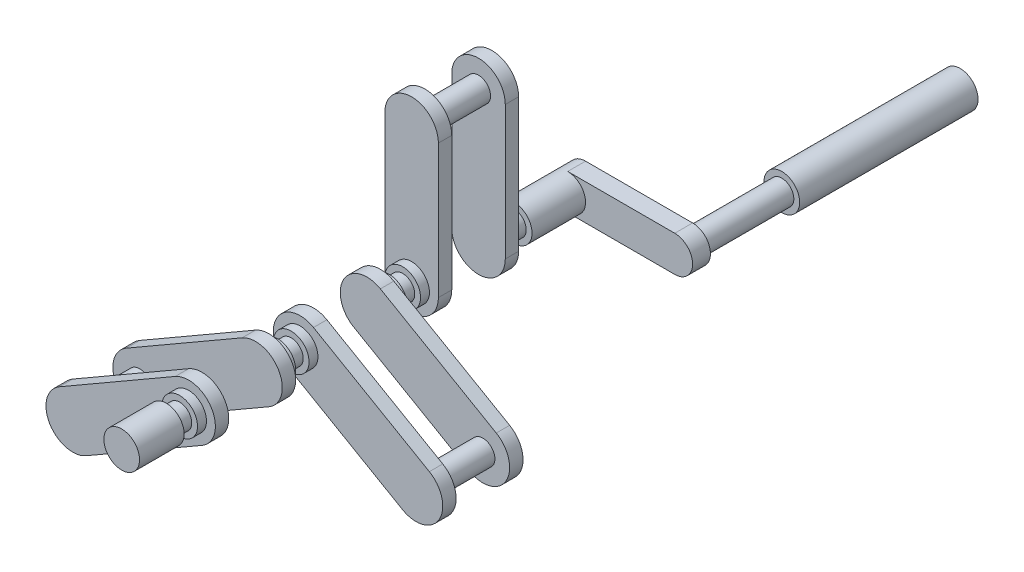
ISO-10303-21;
HEADER;
FILE_DESCRIPTION(('STEP AP214'),'2;1');
FILE_NAME('part.step','',(''),(''),'','','');
FILE_SCHEMA(('AUTOMOTIVE_DESIGN { 1 0 10303 214 1 1 1 1 }'));
ENDSEC;
DATA;
#1=APPLICATION_CONTEXT('core data for automotive mechanical design processes');
#2=APPLICATION_PROTOCOL_DEFINITION('international standard','automotive_design',2000,#1);
#3=PRODUCT_CONTEXT('',#1,'mechanical');
#4=PRODUCT('Part','Part','',(#3));
#5=PRODUCT_RELATED_PRODUCT_CATEGORY('part','',(#4));
#6=PRODUCT_DEFINITION_FORMATION('','',#4);
#7=PRODUCT_DEFINITION_CONTEXT('part definition',#1,'design');
#8=PRODUCT_DEFINITION('design','',#6,#7);
#9=PRODUCT_DEFINITION_SHAPE('','',#8);
#10=(LENGTH_UNIT() NAMED_UNIT(*) SI_UNIT(.MILLI.,.METRE.));
#11=(NAMED_UNIT(*) PLANE_ANGLE_UNIT() SI_UNIT($,.RADIAN.));
#12=(NAMED_UNIT(*) SI_UNIT($,.STERADIAN.) SOLID_ANGLE_UNIT());
#13=UNCERTAINTY_MEASURE_WITH_UNIT(LENGTH_MEASURE(1.E-05),#10,'distance_accuracy_value','');
#14=(GEOMETRIC_REPRESENTATION_CONTEXT(3) GLOBAL_UNCERTAINTY_ASSIGNED_CONTEXT((#13)) GLOBAL_UNIT_ASSIGNED_CONTEXT((#10,
#11,#12)) REPRESENTATION_CONTEXT('',''));
#15=CARTESIAN_POINT('',(0.,0.,0.));
#16=DIRECTION('',(0.,0.,1.));
#17=DIRECTION('',(1.,0.,0.));
#18=AXIS2_PLACEMENT_3D('',#15,#16,#17);
#19=CARTESIAN_POINT('',(0.,0.,-8.));
#20=DIRECTION('',(0.,0.,1.));
#21=DIRECTION('',(1.,0.,0.));
#22=AXIS2_PLACEMENT_3D('',#19,#20,#21);
#23=CYLINDRICAL_SURFACE('',#22,2.);
#24=CARTESIAN_POINT('',(0.,0.,0.));
#25=DIRECTION('',(0.,0.,-1.));
#26=DIRECTION('',(-1.,0.,0.));
#27=AXIS2_PLACEMENT_3D('',#24,#25,#26);
#28=CIRCLE('',#27,2.);
#29=CARTESIAN_POINT('',(-2.,0.,0.));
#30=VERTEX_POINT('',#29);
#31=EDGE_CURVE('E285',#30,#30,#28,.T.);
#32=ORIENTED_EDGE('',*,*,#31,.T.);
#33=EDGE_LOOP('',(#32));
#34=FACE_BOUND('',#33,.T.);
#35=DIRECTION('',(0.,0.,-1.));
#36=VECTOR('',#35,1.);
#37=CARTESIAN_POINT('',(0.,2.,-6.));
#38=LINE('',#37,#36);
#39=CARTESIAN_POINT('',(0.,2.,-6.));
#40=VERTEX_POINT('',#39);
#41=CARTESIAN_POINT('',(0.,2.,-8.));
#42=VERTEX_POINT('',#41);
#43=EDGE_CURVE('E264',#40,#42,#38,.T.);
#44=ORIENTED_EDGE('',*,*,#43,.T.);
#45=CARTESIAN_POINT('',(0.,0.,-8.));
#46=DIRECTION('',(0.,0.,-1.));
#47=DIRECTION('',(-1.,0.,0.));
#48=AXIS2_PLACEMENT_3D('',#45,#46,#47);
#49=CIRCLE('',#48,2.);
#50=CARTESIAN_POINT('',(0.,-2.,-8.));
#51=VERTEX_POINT('',#50);
#52=EDGE_CURVE('E291',#51,#42,#49,.T.);
#53=ORIENTED_EDGE('',*,*,#52,.F.);
#54=DIRECTION('',(0.,0.,-1.));
#55=VECTOR('',#54,1.);
#56=CARTESIAN_POINT('',(0.,-2.,-6.));
#57=LINE('',#56,#55);
#58=CARTESIAN_POINT('',(0.,-2.,-6.));
#59=VERTEX_POINT('',#58);
#60=EDGE_CURVE('E286',#59,#51,#57,.T.);
#61=ORIENTED_EDGE('',*,*,#60,.F.);
#62=CARTESIAN_POINT('',(0.,0.,-6.));
#63=DIRECTION('',(0.,0.,-1.));
#64=DIRECTION('',(-1.,0.,0.));
#65=AXIS2_PLACEMENT_3D('',#62,#63,#64);
#66=CIRCLE('',#65,2.);
#67=EDGE_CURVE('E11',#40,#59,#66,.T.);
#68=ORIENTED_EDGE('',*,*,#67,.F.);
#69=EDGE_LOOP('',(#44,#53,#61,#68));
#70=FACE_BOUND('',#69,.T.);
#71=ADVANCED_FACE('F43',(#34,#70),#23,.T.);
#72=CARTESIAN_POINT('',(0.,15.,4.));
#73=DIRECTION('',(0.,0.,-1.));
#74=DIRECTION('',(-1.,0.,0.));
#75=AXIS2_PLACEMENT_3D('',#72,#73,#74);
#76=CYLINDRICAL_SURFACE('',#75,3.);
#77=CARTESIAN_POINT('',(0.,15.,2.5));
#78=DIRECTION('',(0.,0.,1.));
#79=DIRECTION('',(1.,0.,0.));
#80=AXIS2_PLACEMENT_3D('',#77,#78,#79);
#81=CIRCLE('',#80,3.);
#82=CARTESIAN_POINT('',(3.,15.,2.5));
#83=VERTEX_POINT('',#82);
#84=CARTESIAN_POINT('',(-3.,15.,2.5));
#85=VERTEX_POINT('',#84);
#86=EDGE_CURVE('E567',#83,#85,#81,.T.);
#87=ORIENTED_EDGE('',*,*,#86,.T.);
#88=DIRECTION('',(0.,0.,-1.));
#89=VECTOR('',#88,1.);
#90=CARTESIAN_POINT('',(-3.,15.,4.));
#91=LINE('',#90,#89);
#92=CARTESIAN_POINT('',(-3.,15.,4.));
#93=VERTEX_POINT('',#92);
#94=EDGE_CURVE('E600',#93,#85,#91,.T.);
#95=ORIENTED_EDGE('',*,*,#94,.F.);
#96=CARTESIAN_POINT('',(0.,15.,4.));
#97=DIRECTION('',(0.,0.,1.));
#98=DIRECTION('',(1.,0.,0.));
#99=AXIS2_PLACEMENT_3D('',#96,#97,#98);
#100=CIRCLE('',#99,3.);
#101=CARTESIAN_POINT('',(3.,15.,4.));
#102=VERTEX_POINT('',#101);
#103=EDGE_CURVE('E571',#102,#93,#100,.T.);
#104=ORIENTED_EDGE('',*,*,#103,.F.);
#105=DIRECTION('',(0.,0.,-1.));
#106=VECTOR('',#105,1.);
#107=CARTESIAN_POINT('',(3.,15.,4.));
#108=LINE('',#107,#106);
#109=EDGE_CURVE('E581',#102,#83,#108,.T.);
#110=ORIENTED_EDGE('',*,*,#109,.T.);
#111=EDGE_LOOP('',(#87,#95,#104,#110));
#112=FACE_BOUND('',#111,.T.);
#113=ADVANCED_FACE('F657',(#112),#76,.T.);
#114=CARTESIAN_POINT('',(-3.,15.,4.));
#115=DIRECTION('',(1.,0.,0.));
#116=DIRECTION('',(0.,1.,0.));
#117=AXIS2_PLACEMENT_3D('',#114,#115,#116);
#118=PLANE('',#117);
#119=DIRECTION('',(0.,-1.,0.));
#120=VECTOR('',#119,1.);
#121=CARTESIAN_POINT('',(-3.,15.,2.5));
#122=LINE('',#121,#120);
#123=CARTESIAN_POINT('',(-3.,0.,2.5));
#124=VERTEX_POINT('',#123);
#125=EDGE_CURVE('E585',#85,#124,#122,.T.);
#126=ORIENTED_EDGE('',*,*,#125,.T.);
#127=DIRECTION('',(0.,0.,-1.));
#128=VECTOR('',#127,1.);
#129=CARTESIAN_POINT('',(-3.,0.,4.));
#130=LINE('',#129,#128);
#131=CARTESIAN_POINT('',(-3.,0.,4.));
#132=VERTEX_POINT('',#131);
#133=EDGE_CURVE('E597',#132,#124,#130,.T.);
#134=ORIENTED_EDGE('',*,*,#133,.F.);
#135=DIRECTION('',(0.,-1.,0.));
#136=VECTOR('',#135,1.);
#137=CARTESIAN_POINT('',(-3.,15.,4.));
#138=LINE('',#137,#136);
#139=EDGE_CURVE('E94',#93,#132,#138,.T.);
#140=ORIENTED_EDGE('',*,*,#139,.F.);
#141=ORIENTED_EDGE('',*,*,#94,.T.);
#142=EDGE_LOOP('',(#126,#134,#140,#141));
#143=FACE_BOUND('',#142,.T.);
#144=ADVANCED_FACE('F662',(#143),#118,.F.);
#145=CARTESIAN_POINT('',(0.,0.,4.));
#146=DIRECTION('',(0.,0.,-1.));
#147=DIRECTION('',(-1.,0.,0.));
#148=AXIS2_PLACEMENT_3D('',#145,#146,#147);
#149=CYLINDRICAL_SURFACE('',#148,3.);
#150=CARTESIAN_POINT('',(0.,0.,2.5));
#151=DIRECTION('',(0.,0.,1.));
#152=DIRECTION('',(1.,0.,0.));
#153=AXIS2_PLACEMENT_3D('',#150,#151,#152);
#154=CIRCLE('',#153,3.);
#155=CARTESIAN_POINT('',(3.,0.,2.5));
#156=VERTEX_POINT('',#155);
#157=EDGE_CURVE('E80',#124,#156,#154,.T.);
#158=ORIENTED_EDGE('',*,*,#157,.T.);
#159=DIRECTION('',(0.,0.,-1.));
#160=VECTOR('',#159,1.);
#161=CARTESIAN_POINT('',(3.,0.,4.));
#162=LINE('',#161,#160);
#163=CARTESIAN_POINT('',(3.,0.,4.));
#164=VERTEX_POINT('',#163);
#165=EDGE_CURVE('E594',#164,#156,#162,.T.);
#166=ORIENTED_EDGE('',*,*,#165,.F.);
#167=CARTESIAN_POINT('',(0.,0.,4.));
#168=DIRECTION('',(0.,0.,1.));
#169=DIRECTION('',(1.,0.,0.));
#170=AXIS2_PLACEMENT_3D('',#167,#168,#169);
#171=CIRCLE('',#170,3.);
#172=EDGE_CURVE('E576',#132,#164,#171,.T.);
#173=ORIENTED_EDGE('',*,*,#172,.F.);
#174=ORIENTED_EDGE('',*,*,#133,.T.);
#175=EDGE_LOOP('',(#158,#166,#173,#174));
#176=FACE_BOUND('',#175,.T.);
#177=ADVANCED_FACE('F661',(#176),#149,.T.);
#178=CARTESIAN_POINT('',(3.,15.,4.));
#179=DIRECTION('',(-1.,0.,0.));
#180=DIRECTION('',(0.,-1.,0.));
#181=AXIS2_PLACEMENT_3D('',#178,#179,#180);
#182=PLANE('',#181);
#183=DIRECTION('',(0.,1.,0.));
#184=VECTOR('',#183,1.);
#185=CARTESIAN_POINT('',(3.,15.,2.5));
#186=LINE('',#185,#184);
#187=EDGE_CURVE('E86',#156,#83,#186,.T.);
#188=ORIENTED_EDGE('',*,*,#187,.T.);
#189=ORIENTED_EDGE('',*,*,#109,.F.);
#190=DIRECTION('',(0.,1.,0.));
#191=VECTOR('',#190,1.);
#192=CARTESIAN_POINT('',(3.,15.,4.));
#193=LINE('',#192,#191);
#194=EDGE_CURVE('E62',#164,#102,#193,.T.);
#195=ORIENTED_EDGE('',*,*,#194,.F.);
#196=ORIENTED_EDGE('',*,*,#165,.T.);
#197=EDGE_LOOP('',(#188,#189,#195,#196));
#198=FACE_BOUND('',#197,.T.);
#199=ADVANCED_FACE('F659',(#198),#182,.F.);
#200=CARTESIAN_POINT('',(0.,15.,4.));
#201=DIRECTION('',(0.,0.,1.));
#202=DIRECTION('',(1.,0.,0.));
#203=AXIS2_PLACEMENT_3D('',#200,#201,#202);
#204=PLANE('',#203);
#205=CARTESIAN_POINT('',(0.,15.,4.));
#206=DIRECTION('',(0.,0.,1.));
#207=DIRECTION('',(1.,0.,0.));
#208=AXIS2_PLACEMENT_3D('',#205,#206,#207);
#209=CIRCLE('',#208,1.35);
#210=CARTESIAN_POINT('',(1.35,15.,4.));
#211=VERTEX_POINT('',#210);
#212=EDGE_CURVE('E562',#211,#211,#209,.T.);
#213=ORIENTED_EDGE('',*,*,#212,.F.);
#214=EDGE_LOOP('',(#213));
#215=FACE_BOUND('',#214,.T.);
#216=ORIENTED_EDGE('',*,*,#103,.T.);
#217=ORIENTED_EDGE('',*,*,#139,.T.);
#218=ORIENTED_EDGE('',*,*,#172,.T.);
#219=ORIENTED_EDGE('',*,*,#194,.T.);
#220=EDGE_LOOP('',(#216,#217,#218,#219));
#221=FACE_BOUND('',#220,.T.);
#222=ADVANCED_FACE('F652',(#215,#221),#204,.T.);
#223=CARTESIAN_POINT('',(0.,15.,2.5));
#224=DIRECTION('',(0.,0.,1.));
#225=DIRECTION('',(1.,0.,0.));
#226=AXIS2_PLACEMENT_3D('',#223,#224,#225);
#227=PLANE('',#226);
#228=CARTESIAN_POINT('',(0.,0.,2.5));
#229=DIRECTION('',(0.,0.,1.));
#230=DIRECTION('',(1.,0.,0.));
#231=AXIS2_PLACEMENT_3D('',#228,#229,#230);
#232=CIRCLE('',#231,2.);
#233=CARTESIAN_POINT('',(2.,0.,2.5));
#234=VERTEX_POINT('',#233);
#235=EDGE_CURVE('E54',#234,#234,#232,.F.);
#236=ORIENTED_EDGE('',*,*,#235,.F.);
#237=EDGE_LOOP('',(#236));
#238=FACE_BOUND('',#237,.T.);
#239=ORIENTED_EDGE('',*,*,#86,.F.);
#240=ORIENTED_EDGE('',*,*,#187,.F.);
#241=ORIENTED_EDGE('',*,*,#157,.F.);
#242=ORIENTED_EDGE('',*,*,#125,.F.);
#243=EDGE_LOOP('',(#239,#240,#241,#242));
#244=FACE_BOUND('',#243,.T.);
#245=ADVANCED_FACE('F648',(#238,#244),#227,.F.);
#246=CARTESIAN_POINT('',(0.,15.,10.));
#247=DIRECTION('',(0.,0.,-1.));
#248=DIRECTION('',(-1.,0.,0.));
#249=AXIS2_PLACEMENT_3D('',#246,#247,#248);
#250=CYLINDRICAL_SURFACE('',#249,1.35);
#251=CARTESIAN_POINT('',(0.,15.,10.));
#252=DIRECTION('',(0.,0.,1.));
#253=DIRECTION('',(1.,0.,0.));
#254=AXIS2_PLACEMENT_3D('',#251,#252,#253);
#255=CIRCLE('',#254,1.35);
#256=CARTESIAN_POINT('',(1.35,15.,10.));
#257=VERTEX_POINT('',#256);
#258=EDGE_CURVE('E563',#257,#257,#255,.T.);
#259=ORIENTED_EDGE('',*,*,#258,.F.);
#260=EDGE_LOOP('',(#259));
#261=FACE_BOUND('',#260,.T.);
#262=ORIENTED_EDGE('',*,*,#212,.T.);
#263=EDGE_LOOP('',(#262));
#264=FACE_BOUND('',#263,.T.);
#265=ADVANCED_FACE('F651',(#261,#264),#250,.T.);
#266=CARTESIAN_POINT('',(0.,15.,11.5));
#267=DIRECTION('',(0.,0.,-1.));
#268=DIRECTION('',(-1.,0.,0.));
#269=AXIS2_PLACEMENT_3D('',#266,#267,#268);
#270=CYLINDRICAL_SURFACE('',#269,3.);
#271=CARTESIAN_POINT('',(0.,15.,10.));
#272=DIRECTION('',(0.,0.,1.));
#273=DIRECTION('',(1.,0.,0.));
#274=AXIS2_PLACEMENT_3D('',#271,#272,#273);
#275=CIRCLE('',#274,3.);
#276=CARTESIAN_POINT('',(3.,15.,10.));
#277=VERTEX_POINT('',#276);
#278=CARTESIAN_POINT('',(-3.,15.,10.));
#279=VERTEX_POINT('',#278);
#280=EDGE_CURVE('E520',#277,#279,#275,.T.);
#281=ORIENTED_EDGE('',*,*,#280,.T.);
#282=DIRECTION('',(0.,0.,-1.));
#283=VECTOR('',#282,1.);
#284=CARTESIAN_POINT('',(-3.,15.,11.5));
#285=LINE('',#284,#283);
#286=CARTESIAN_POINT('',(-3.,15.,11.5));
#287=VERTEX_POINT('',#286);
#288=EDGE_CURVE('E558',#287,#279,#285,.T.);
#289=ORIENTED_EDGE('',*,*,#288,.F.);
#290=CARTESIAN_POINT('',(0.,15.,11.5));
#291=DIRECTION('',(0.,0.,1.));
#292=DIRECTION('',(1.,0.,0.));
#293=AXIS2_PLACEMENT_3D('',#290,#291,#292);
#294=CIRCLE('',#293,3.);
#295=CARTESIAN_POINT('',(3.,15.,11.5));
#296=VERTEX_POINT('',#295);
#297=EDGE_CURVE('E521',#296,#287,#294,.T.);
#298=ORIENTED_EDGE('',*,*,#297,.F.);
#299=DIRECTION('',(0.,0.,-1.));
#300=VECTOR('',#299,1.);
#301=CARTESIAN_POINT('',(3.,15.,11.5));
#302=LINE('',#301,#300);
#303=EDGE_CURVE('E535',#296,#277,#302,.T.);
#304=ORIENTED_EDGE('',*,*,#303,.T.);
#305=EDGE_LOOP('',(#281,#289,#298,#304));
#306=FACE_BOUND('',#305,.T.);
#307=ADVANCED_FACE('F848',(#306),#270,.T.);
#308=CARTESIAN_POINT('',(-3.,15.,11.5));
#309=DIRECTION('',(1.,0.,0.));
#310=DIRECTION('',(0.,1.,0.));
#311=AXIS2_PLACEMENT_3D('',#308,#309,#310);
#312=PLANE('',#311);
#313=DIRECTION('',(0.,-1.,0.));
#314=VECTOR('',#313,1.);
#315=CARTESIAN_POINT('',(-3.,15.,10.));
#316=LINE('',#315,#314);
#317=CARTESIAN_POINT('',(-3.,0.,10.));
#318=VERTEX_POINT('',#317);
#319=EDGE_CURVE('E539',#279,#318,#316,.T.);
#320=ORIENTED_EDGE('',*,*,#319,.T.);
#321=DIRECTION('',(0.,0.,-1.));
#322=VECTOR('',#321,1.);
#323=CARTESIAN_POINT('',(-3.,0.,11.5));
#324=LINE('',#323,#322);
#325=CARTESIAN_POINT('',(-3.,0.,11.5));
#326=VERTEX_POINT('',#325);
#327=EDGE_CURVE('E554',#326,#318,#324,.T.);
#328=ORIENTED_EDGE('',*,*,#327,.F.);
#329=DIRECTION('',(0.,-1.,0.));
#330=VECTOR('',#329,1.);
#331=CARTESIAN_POINT('',(-3.,15.,11.5));
#332=LINE('',#331,#330);
#333=EDGE_CURVE('E525',#287,#326,#332,.T.);
#334=ORIENTED_EDGE('',*,*,#333,.F.);
#335=ORIENTED_EDGE('',*,*,#288,.T.);
#336=EDGE_LOOP('',(#320,#328,#334,#335));
#337=FACE_BOUND('',#336,.T.);
#338=ADVANCED_FACE('F844',(#337),#312,.F.);
#339=CARTESIAN_POINT('',(0.,0.,11.5));
#340=DIRECTION('',(0.,0.,-1.));
#341=DIRECTION('',(-1.,0.,0.));
#342=AXIS2_PLACEMENT_3D('',#339,#340,#341);
#343=CYLINDRICAL_SURFACE('',#342,3.);
#344=CARTESIAN_POINT('',(0.,0.,10.));
#345=DIRECTION('',(0.,0.,1.));
#346=DIRECTION('',(1.,0.,0.));
#347=AXIS2_PLACEMENT_3D('',#344,#345,#346);
#348=CIRCLE('',#347,3.);
#349=CARTESIAN_POINT('',(3.,0.,10.));
#350=VERTEX_POINT('',#349);
#351=EDGE_CURVE('E542',#318,#350,#348,.T.);
#352=ORIENTED_EDGE('',*,*,#351,.T.);
#353=DIRECTION('',(0.,0.,-1.));
#354=VECTOR('',#353,1.);
#355=CARTESIAN_POINT('',(3.,0.,11.5));
#356=LINE('',#355,#354);
#357=CARTESIAN_POINT('',(3.,0.,11.5));
#358=VERTEX_POINT('',#357);
#359=EDGE_CURVE('E550',#358,#350,#356,.T.);
#360=ORIENTED_EDGE('',*,*,#359,.F.);
#361=CARTESIAN_POINT('',(0.,0.,11.5));
#362=DIRECTION('',(0.,0.,1.));
#363=DIRECTION('',(1.,0.,0.));
#364=AXIS2_PLACEMENT_3D('',#361,#362,#363);
#365=CIRCLE('',#364,3.);
#366=EDGE_CURVE('E529',#326,#358,#365,.T.);
#367=ORIENTED_EDGE('',*,*,#366,.F.);
#368=ORIENTED_EDGE('',*,*,#327,.T.);
#369=EDGE_LOOP('',(#352,#360,#367,#368));
#370=FACE_BOUND('',#369,.T.);
#371=ADVANCED_FACE('F840',(#370),#343,.T.);
#372=CARTESIAN_POINT('',(3.,15.,11.5));
#373=DIRECTION('',(-1.,0.,0.));
#374=DIRECTION('',(0.,-1.,0.));
#375=AXIS2_PLACEMENT_3D('',#372,#373,#374);
#376=PLANE('',#375);
#377=DIRECTION('',(0.,1.,0.));
#378=VECTOR('',#377,1.);
#379=CARTESIAN_POINT('',(3.,15.,10.));
#380=LINE('',#379,#378);
#381=EDGE_CURVE('E526',#350,#277,#380,.T.);
#382=ORIENTED_EDGE('',*,*,#381,.T.);
#383=ORIENTED_EDGE('',*,*,#303,.F.);
#384=DIRECTION('',(0.,1.,0.));
#385=VECTOR('',#384,1.);
#386=CARTESIAN_POINT('',(3.,15.,11.5));
#387=LINE('',#386,#385);
#388=EDGE_CURVE('E532',#358,#296,#387,.T.);
#389=ORIENTED_EDGE('',*,*,#388,.F.);
#390=ORIENTED_EDGE('',*,*,#359,.T.);
#391=EDGE_LOOP('',(#382,#383,#389,#390));
#392=FACE_BOUND('',#391,.T.);
#393=ADVANCED_FACE('F833',(#392),#376,.F.);
#394=CARTESIAN_POINT('',(0.,15.,11.5));
#395=DIRECTION('',(0.,0.,1.));
#396=DIRECTION('',(1.,0.,0.));
#397=AXIS2_PLACEMENT_3D('',#394,#395,#396);
#398=PLANE('',#397);
#399=CARTESIAN_POINT('',(0.,0.,11.5));
#400=DIRECTION('',(0.,0.,1.));
#401=DIRECTION('',(1.,0.,0.));
#402=AXIS2_PLACEMENT_3D('',#399,#400,#401);
#403=CIRCLE('',#402,2.);
#404=CARTESIAN_POINT('',(2.,0.,11.5));
#405=VERTEX_POINT('',#404);
#406=EDGE_CURVE('E424',#405,#405,#403,.T.);
#407=ORIENTED_EDGE('',*,*,#406,.F.);
#408=EDGE_LOOP('',(#407));
#409=FACE_BOUND('',#408,.T.);
#410=ORIENTED_EDGE('',*,*,#297,.T.);
#411=ORIENTED_EDGE('',*,*,#333,.T.);
#412=ORIENTED_EDGE('',*,*,#366,.T.);
#413=ORIENTED_EDGE('',*,*,#388,.T.);
#414=EDGE_LOOP('',(#410,#411,#412,#413));
#415=FACE_BOUND('',#414,.T.);
#416=ADVANCED_FACE('F830',(#409,#415),#398,.T.);
#417=CARTESIAN_POINT('',(0.,15.,10.));
#418=DIRECTION('',(0.,0.,1.));
#419=DIRECTION('',(1.,0.,0.));
#420=AXIS2_PLACEMENT_3D('',#417,#418,#419);
#421=PLANE('',#420);
#422=ORIENTED_EDGE('',*,*,#258,.T.);
#423=EDGE_LOOP('',(#422));
#424=FACE_BOUND('',#423,.T.);
#425=ORIENTED_EDGE('',*,*,#280,.F.);
#426=ORIENTED_EDGE('',*,*,#381,.F.);
#427=ORIENTED_EDGE('',*,*,#351,.F.);
#428=ORIENTED_EDGE('',*,*,#319,.F.);
#429=EDGE_LOOP('',(#425,#426,#427,#428));
#430=FACE_BOUND('',#429,.T.);
#431=ADVANCED_FACE('F775',(#424,#430),#421,.F.);
#432=CARTESIAN_POINT('',(0.,0.,12.5));
#433=DIRECTION('',(0.,0.,-1.));
#434=DIRECTION('',(-1.,0.,0.));
#435=AXIS2_PLACEMENT_3D('',#432,#433,#434);
#436=CYLINDRICAL_SURFACE('',#435,2.);
#437=CARTESIAN_POINT('',(0.,0.,12.5));
#438=DIRECTION('',(0.,0.,1.));
#439=DIRECTION('',(1.,0.,0.));
#440=AXIS2_PLACEMENT_3D('',#437,#438,#439);
#441=CIRCLE('',#440,2.);
#442=CARTESIAN_POINT('',(2.,0.,12.5));
#443=VERTEX_POINT('',#442);
#444=EDGE_CURVE('E419',#443,#443,#441,.T.);
#445=ORIENTED_EDGE('',*,*,#444,.F.);
#446=EDGE_LOOP('',(#445));
#447=FACE_BOUND('',#446,.T.);
#448=ORIENTED_EDGE('',*,*,#406,.T.);
#449=EDGE_LOOP('',(#448));
#450=FACE_BOUND('',#449,.T.);
#451=ADVANCED_FACE('F771',(#447,#450),#436,.T.);
#452=CARTESIAN_POINT('',(0.,0.,12.5));
#453=DIRECTION('',(0.,0.,1.));
#454=DIRECTION('',(1.,0.,0.));
#455=AXIS2_PLACEMENT_3D('',#452,#453,#454);
#456=PLANE('',#455);
#457=CARTESIAN_POINT('',(0.,0.,12.5));
#458=DIRECTION('',(0.,0.,1.));
#459=DIRECTION('',(1.,0.,0.));
#460=AXIS2_PLACEMENT_3D('',#457,#458,#459);
#461=CIRCLE('',#460,1.35);
#462=CARTESIAN_POINT('',(1.35,0.,12.5));
#463=VERTEX_POINT('',#462);
#464=EDGE_CURVE('E423',#463,#463,#461,.T.);
#465=ORIENTED_EDGE('',*,*,#464,.F.);
#466=EDGE_LOOP('',(#465));
#467=FACE_BOUND('',#466,.T.);
#468=ORIENTED_EDGE('',*,*,#444,.T.);
#469=EDGE_LOOP('',(#468));
#470=FACE_BOUND('',#469,.T.);
#471=ADVANCED_FACE('F768',(#467,#470),#456,.T.);
#472=CARTESIAN_POINT('',(0.,0.,15.));
#473=DIRECTION('',(0.,0.,-1.));
#474=DIRECTION('',(-1.,0.,0.));
#475=AXIS2_PLACEMENT_3D('',#472,#473,#474);
#476=CYLINDRICAL_SURFACE('',#475,1.35);
#477=CARTESIAN_POINT('',(0.,0.,14.));
#478=DIRECTION('',(0.,0.,-1.));
#479=DIRECTION('',(-1.,0.,0.));
#480=AXIS2_PLACEMENT_3D('',#477,#478,#479);
#481=CIRCLE('',#480,1.35);
#482=CARTESIAN_POINT('',(-1.35,0.,14.));
#483=VERTEX_POINT('',#482);
#484=EDGE_CURVE('E418',#483,#483,#481,.T.);
#485=ORIENTED_EDGE('',*,*,#484,.T.);
#486=EDGE_LOOP('',(#485));
#487=FACE_BOUND('',#486,.T.);
#488=ORIENTED_EDGE('',*,*,#464,.T.);
#489=EDGE_LOOP('',(#488));
#490=FACE_BOUND('',#489,.T.);
#491=ADVANCED_FACE('F766',(#487,#490),#476,.T.);
#492=CARTESIAN_POINT('',(0.,0.,14.));
#493=DIRECTION('',(0.,0.,1.));
#494=DIRECTION('',(1.,0.,0.));
#495=AXIS2_PLACEMENT_3D('',#492,#493,#494);
#496=CYLINDRICAL_SURFACE('',#495,2.);
#497=CARTESIAN_POINT('',(0.,0.,14.));
#498=DIRECTION('',(0.,0.,-1.));
#499=DIRECTION('',(-1.,0.,0.));
#500=AXIS2_PLACEMENT_3D('',#497,#498,#499);
#501=CIRCLE('',#500,2.);
#502=CARTESIAN_POINT('',(-2.,0.,14.));
#503=VERTEX_POINT('',#502);
#504=EDGE_CURVE('E414',#503,#503,#501,.T.);
#505=ORIENTED_EDGE('',*,*,#504,.F.);
#506=EDGE_LOOP('',(#505));
#507=FACE_BOUND('',#506,.T.);
#508=CARTESIAN_POINT('',(0.,0.,15.));
#509=DIRECTION('',(0.,0.,1.));
#510=DIRECTION('',(1.,0.,0.));
#511=AXIS2_PLACEMENT_3D('',#508,#509,#510);
#512=CIRCLE('',#511,2.);
#513=CARTESIAN_POINT('',(2.,0.,15.));
#514=VERTEX_POINT('',#513);
#515=EDGE_CURVE('E603',#514,#514,#512,.F.);
#516=ORIENTED_EDGE('',*,*,#515,.T.);
#517=EDGE_LOOP('',(#516));
#518=FACE_BOUND('',#517,.T.);
#519=ADVANCED_FACE('F762',(#507,#518),#496,.T.);
#520=CARTESIAN_POINT('',(0.,0.,14.));
#521=DIRECTION('',(0.,0.,-1.));
#522=DIRECTION('',(-1.,0.,0.));
#523=AXIS2_PLACEMENT_3D('',#520,#521,#522);
#524=PLANE('',#523);
#525=ORIENTED_EDGE('',*,*,#484,.F.);
#526=EDGE_LOOP('',(#525));
#527=FACE_BOUND('',#526,.T.);
#528=ORIENTED_EDGE('',*,*,#504,.T.);
#529=EDGE_LOOP('',(#528));
#530=FACE_BOUND('',#529,.T.);
#531=ADVANCED_FACE('F758',(#527,#530),#524,.T.);
#532=CARTESIAN_POINT('',(0.,0.,24.));
#533=DIRECTION('',(0.,0.,1.));
#534=DIRECTION('',(1.,0.,0.));
#535=AXIS2_PLACEMENT_3D('',#532,#533,#534);
#536=PLANE('',#535);
#537=CARTESIAN_POINT('',(0.,0.,24.));
#538=DIRECTION('',(0.,0.,1.));
#539=DIRECTION('',(1.,0.,0.));
#540=AXIS2_PLACEMENT_3D('',#537,#538,#539);
#541=CIRCLE('',#540,2.);
#542=CARTESIAN_POINT('',(2.,0.,24.));
#543=VERTEX_POINT('',#542);
#544=EDGE_CURVE('E318',#543,#543,#541,.T.);
#545=ORIENTED_EDGE('',*,*,#544,.F.);
#546=EDGE_LOOP('',(#545));
#547=FACE_BOUND('',#546,.T.);
#548=CARTESIAN_POINT('',(0.,0.,24.));
#549=DIRECTION('',(0.,0.,1.));
#550=DIRECTION('',(1.,0.,0.));
#551=AXIS2_PLACEMENT_3D('',#548,#549,#550);
#552=CIRCLE('',#551,3.);
#553=CARTESIAN_POINT('',(1.50000000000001,2.59807621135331,24.));
#554=VERTEX_POINT('',#553);
#555=CARTESIAN_POINT('',(-1.50000000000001,-2.59807621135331,24.));
#556=VERTEX_POINT('',#555);
#557=EDGE_CURVE('E428',#554,#556,#552,.T.);
#558=ORIENTED_EDGE('',*,*,#557,.T.);
#559=DIRECTION('',(0.866025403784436,-0.500000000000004,0.));
#560=VECTOR('',#559,1.);
#561=CARTESIAN_POINT('',(-1.50000000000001,-2.59807621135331,24.));
#562=LINE('',#561,#560);
#563=CARTESIAN_POINT('',(11.4903810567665,-10.0980762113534,24.));
#564=VERTEX_POINT('',#563);
#565=EDGE_CURVE('E432',#556,#564,#562,.T.);
#566=ORIENTED_EDGE('',*,*,#565,.T.);
#567=CARTESIAN_POINT('',(12.9903810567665,-7.50000000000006,24.));
#568=DIRECTION('',(0.,0.,1.));
#569=DIRECTION('',(1.,0.,0.));
#570=AXIS2_PLACEMENT_3D('',#567,#568,#569);
#571=CIRCLE('',#570,3.);
#572=CARTESIAN_POINT('',(14.4903810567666,-4.90192378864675,24.));
#573=VERTEX_POINT('',#572);
#574=EDGE_CURVE('E436',#564,#573,#571,.T.);
#575=ORIENTED_EDGE('',*,*,#574,.T.);
#576=DIRECTION('',(-0.866025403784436,0.500000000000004,0.));
#577=VECTOR('',#576,1.);
#578=CARTESIAN_POINT('',(1.50000000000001,2.59807621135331,24.));
#579=LINE('',#578,#577);
#580=EDGE_CURVE('E439',#573,#554,#579,.T.);
#581=ORIENTED_EDGE('',*,*,#580,.T.);
#582=EDGE_LOOP('',(#558,#566,#575,#581));
#583=FACE_BOUND('',#582,.T.);
#584=ADVANCED_FACE('F761',(#547,#583),#536,.T.);
#585=CARTESIAN_POINT('',(-1.50000000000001,-2.59807621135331,24.));
#586=DIRECTION('',(0.500000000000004,0.866025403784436,0.));
#587=DIRECTION('',(-0.866025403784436,0.500000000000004,0.));
#588=AXIS2_PLACEMENT_3D('',#585,#586,#587);
#589=PLANE('',#588);
#590=DIRECTION('',(0.866025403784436,-0.500000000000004,0.));
#591=VECTOR('',#590,1.);
#592=CARTESIAN_POINT('',(-1.50000000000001,-2.59807621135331,22.5));
#593=LINE('',#592,#591);
#594=CARTESIAN_POINT('',(-1.50000000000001,-2.59807621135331,22.5));
#595=VERTEX_POINT('',#594);
#596=CARTESIAN_POINT('',(11.4903810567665,-10.0980762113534,22.5));
#597=VERTEX_POINT('',#596);
#598=EDGE_CURVE('E447',#595,#597,#593,.T.);
#599=ORIENTED_EDGE('',*,*,#598,.T.);
#600=DIRECTION('',(0.,0.,-1.));
#601=VECTOR('',#600,1.);
#602=CARTESIAN_POINT('',(11.4903810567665,-10.0980762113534,24.));
#603=LINE('',#602,#601);
#604=EDGE_CURVE('E462',#564,#597,#603,.T.);
#605=ORIENTED_EDGE('',*,*,#604,.F.);
#606=ORIENTED_EDGE('',*,*,#565,.F.);
#607=DIRECTION('',(0.,0.,-1.));
#608=VECTOR('',#607,1.);
#609=CARTESIAN_POINT('',(-1.50000000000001,-2.59807621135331,24.));
#610=LINE('',#609,#608);
#611=EDGE_CURVE('E466',#556,#595,#610,.T.);
#612=ORIENTED_EDGE('',*,*,#611,.T.);
#613=EDGE_LOOP('',(#599,#605,#606,#612));
#614=FACE_BOUND('',#613,.T.);
#615=ADVANCED_FACE('F779',(#614),#589,.F.);
#616=CARTESIAN_POINT('',(12.9903810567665,-7.50000000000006,24.));
#617=DIRECTION('',(0.,0.,-1.));
#618=DIRECTION('',(-1.,0.,0.));
#619=AXIS2_PLACEMENT_3D('',#616,#617,#618);
#620=CYLINDRICAL_SURFACE('',#619,3.);
#621=CARTESIAN_POINT('',(12.9903810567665,-7.50000000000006,22.5));
#622=DIRECTION('',(0.,0.,1.));
#623=DIRECTION('',(1.,0.,0.));
#624=AXIS2_PLACEMENT_3D('',#621,#622,#623);
#625=CIRCLE('',#624,3.);
#626=CARTESIAN_POINT('',(14.4903810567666,-4.90192378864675,22.5));
#627=VERTEX_POINT('',#626);
#628=EDGE_CURVE('E450',#597,#627,#625,.T.);
#629=ORIENTED_EDGE('',*,*,#628,.T.);
#630=DIRECTION('',(0.,0.,-1.));
#631=VECTOR('',#630,1.);
#632=CARTESIAN_POINT('',(14.4903810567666,-4.90192378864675,24.));
#633=LINE('',#632,#631);
#634=EDGE_CURVE('E458',#573,#627,#633,.T.);
#635=ORIENTED_EDGE('',*,*,#634,.F.);
#636=ORIENTED_EDGE('',*,*,#574,.F.);
#637=ORIENTED_EDGE('',*,*,#604,.T.);
#638=EDGE_LOOP('',(#629,#635,#636,#637));
#639=FACE_BOUND('',#638,.T.);
#640=ADVANCED_FACE('F790',(#639),#620,.T.);
#641=CARTESIAN_POINT('',(1.50000000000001,2.59807621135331,24.));
#642=DIRECTION('',(-0.500000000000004,-0.866025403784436,0.));
#643=DIRECTION('',(0.866025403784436,-0.500000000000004,0.));
#644=AXIS2_PLACEMENT_3D('',#641,#642,#643);
#645=PLANE('',#644);
#646=DIRECTION('',(-0.866025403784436,0.500000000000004,0.));
#647=VECTOR('',#646,1.);
#648=CARTESIAN_POINT('',(1.50000000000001,2.59807621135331,22.5));
#649=LINE('',#648,#647);
#650=CARTESIAN_POINT('',(1.50000000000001,2.59807621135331,22.5));
#651=VERTEX_POINT('',#650);
#652=EDGE_CURVE('E433',#627,#651,#649,.T.);
#653=ORIENTED_EDGE('',*,*,#652,.T.);
#654=DIRECTION('',(0.,0.,-1.));
#655=VECTOR('',#654,1.);
#656=CARTESIAN_POINT('',(1.50000000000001,2.59807621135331,24.));
#657=LINE('',#656,#655);
#658=EDGE_CURVE('E442',#554,#651,#657,.T.);
#659=ORIENTED_EDGE('',*,*,#658,.F.);
#660=ORIENTED_EDGE('',*,*,#580,.F.);
#661=ORIENTED_EDGE('',*,*,#634,.T.);
#662=EDGE_LOOP('',(#653,#659,#660,#661));
#663=FACE_BOUND('',#662,.T.);
#664=ADVANCED_FACE('F787',(#663),#645,.F.);
#665=CARTESIAN_POINT('',(0.,0.,24.));
#666=DIRECTION('',(0.,0.,-1.));
#667=DIRECTION('',(-1.,0.,0.));
#668=AXIS2_PLACEMENT_3D('',#665,#666,#667);
#669=CYLINDRICAL_SURFACE('',#668,3.);
#670=CARTESIAN_POINT('',(0.,0.,22.5));
#671=DIRECTION('',(0.,0.,1.));
#672=DIRECTION('',(1.,0.,0.));
#673=AXIS2_PLACEMENT_3D('',#670,#671,#672);
#674=CIRCLE('',#673,3.);
#675=EDGE_CURVE('E443',#651,#595,#674,.T.);
#676=ORIENTED_EDGE('',*,*,#675,.T.);
#677=ORIENTED_EDGE('',*,*,#611,.F.);
#678=ORIENTED_EDGE('',*,*,#557,.F.);
#679=ORIENTED_EDGE('',*,*,#658,.T.);
#680=EDGE_LOOP('',(#676,#677,#678,#679));
#681=FACE_BOUND('',#680,.T.);
#682=ADVANCED_FACE('F785',(#681),#669,.T.);
#683=CARTESIAN_POINT('',(0.,0.,22.5));
#684=DIRECTION('',(0.,0.,1.));
#685=DIRECTION('',(1.,0.,0.));
#686=AXIS2_PLACEMENT_3D('',#683,#684,#685);
#687=PLANE('',#686);
#688=CARTESIAN_POINT('',(12.9903810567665,-7.50000000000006,22.5));
#689=DIRECTION('',(0.,0.,1.));
#690=DIRECTION('',(1.,0.,0.));
#691=AXIS2_PLACEMENT_3D('',#688,#689,#690);
#692=CIRCLE('',#691,1.35);
#693=CARTESIAN_POINT('',(14.3403810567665,-7.50000000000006,22.5));
#694=VERTEX_POINT('',#693);
#695=EDGE_CURVE('E471',#694,#694,#692,.T.);
#696=ORIENTED_EDGE('',*,*,#695,.T.);
#697=EDGE_LOOP('',(#696));
#698=FACE_BOUND('',#697,.T.);
#699=ORIENTED_EDGE('',*,*,#675,.F.);
#700=ORIENTED_EDGE('',*,*,#652,.F.);
#701=ORIENTED_EDGE('',*,*,#628,.F.);
#702=ORIENTED_EDGE('',*,*,#598,.F.);
#703=EDGE_LOOP('',(#699,#700,#701,#702));
#704=FACE_BOUND('',#703,.T.);
#705=ADVANCED_FACE('F781',(#698,#704),#687,.F.);
#706=CARTESIAN_POINT('',(12.9903810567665,-7.50000000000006,22.5));
#707=DIRECTION('',(0.,0.,-1.));
#708=DIRECTION('',(-1.,0.,0.));
#709=AXIS2_PLACEMENT_3D('',#706,#707,#708);
#710=CYLINDRICAL_SURFACE('',#709,1.35);
#711=ORIENTED_EDGE('',*,*,#695,.F.);
#712=EDGE_LOOP('',(#711));
#713=FACE_BOUND('',#712,.T.);
#714=CARTESIAN_POINT('',(12.9903810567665,-7.50000000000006,16.5));
#715=DIRECTION('',(0.,0.,1.));
#716=DIRECTION('',(1.,0.,0.));
#717=AXIS2_PLACEMENT_3D('',#714,#715,#716);
#718=CIRCLE('',#717,1.35);
#719=CARTESIAN_POINT('',(14.3403810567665,-7.50000000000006,16.5));
#720=VERTEX_POINT('',#719);
#721=EDGE_CURVE('E470',#720,#720,#718,.T.);
#722=ORIENTED_EDGE('',*,*,#721,.T.);
#723=EDGE_LOOP('',(#722));
#724=FACE_BOUND('',#723,.T.);
#725=ADVANCED_FACE('F784',(#713,#724),#710,.T.);
#726=CARTESIAN_POINT('',(12.9903810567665,-7.50000000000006,16.5));
#727=DIRECTION('',(0.,0.,1.));
#728=DIRECTION('',(1.,0.,0.));
#729=AXIS2_PLACEMENT_3D('',#726,#727,#728);
#730=PLANE('',#729);
#731=ORIENTED_EDGE('',*,*,#721,.F.);
#732=EDGE_LOOP('',(#731));
#733=FACE_BOUND('',#732,.T.);
#734=CARTESIAN_POINT('',(12.9903810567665,-7.50000000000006,16.5));
#735=DIRECTION('',(0.,0.,1.));
#736=DIRECTION('',(1.,0.,0.));
#737=AXIS2_PLACEMENT_3D('',#734,#735,#736);
#738=CIRCLE('',#737,3.);
#739=CARTESIAN_POINT('',(11.4903810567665,-10.0980762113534,16.5));
#740=VERTEX_POINT('',#739);
#741=CARTESIAN_POINT('',(14.4903810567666,-4.90192378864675,16.5));
#742=VERTEX_POINT('',#741);
#743=EDGE_CURVE('E479',#740,#742,#738,.T.);
#744=ORIENTED_EDGE('',*,*,#743,.T.);
#745=DIRECTION('',(-0.866025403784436,0.500000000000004,0.));
#746=VECTOR('',#745,1.);
#747=CARTESIAN_POINT('',(14.4903810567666,-4.90192378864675,16.5));
#748=LINE('',#747,#746);
#749=CARTESIAN_POINT('',(1.50000000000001,2.59807621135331,16.5));
#750=VERTEX_POINT('',#749);
#751=EDGE_CURVE('E483',#742,#750,#748,.T.);
#752=ORIENTED_EDGE('',*,*,#751,.T.);
#753=CARTESIAN_POINT('',(0.,0.,16.5));
#754=DIRECTION('',(0.,0.,1.));
#755=DIRECTION('',(1.,0.,0.));
#756=AXIS2_PLACEMENT_3D('',#753,#754,#755);
#757=CIRCLE('',#756,3.);
#758=CARTESIAN_POINT('',(-1.50000000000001,-2.59807621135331,16.5));
#759=VERTEX_POINT('',#758);
#760=EDGE_CURVE('E487',#750,#759,#757,.T.);
#761=ORIENTED_EDGE('',*,*,#760,.T.);
#762=DIRECTION('',(0.866025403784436,-0.500000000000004,0.));
#763=VECTOR('',#762,1.);
#764=CARTESIAN_POINT('',(11.4903810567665,-10.0980762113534,16.5));
#765=LINE('',#764,#763);
#766=EDGE_CURVE('E490',#759,#740,#765,.T.);
#767=ORIENTED_EDGE('',*,*,#766,.T.);
#768=EDGE_LOOP('',(#744,#752,#761,#767));
#769=FACE_BOUND('',#768,.T.);
#770=ADVANCED_FACE('F803',(#733,#769),#730,.T.);
#771=CARTESIAN_POINT('',(14.4903810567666,-4.90192378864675,16.5));
#772=DIRECTION('',(-0.500000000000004,-0.866025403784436,0.));
#773=DIRECTION('',(0.866025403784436,-0.500000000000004,0.));
#774=AXIS2_PLACEMENT_3D('',#771,#772,#773);
#775=PLANE('',#774);
#776=DIRECTION('',(-0.866025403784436,0.500000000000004,0.));
#777=VECTOR('',#776,1.);
#778=CARTESIAN_POINT('',(14.4903810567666,-4.90192378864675,15.));
#779=LINE('',#778,#777);
#780=CARTESIAN_POINT('',(14.4903810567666,-4.90192378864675,15.));
#781=VERTEX_POINT('',#780);
#782=CARTESIAN_POINT('',(1.50000000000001,2.59807621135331,15.));
#783=VERTEX_POINT('',#782);
#784=EDGE_CURVE('E497',#781,#783,#779,.T.);
#785=ORIENTED_EDGE('',*,*,#784,.T.);
#786=DIRECTION('',(0.,0.,-1.));
#787=VECTOR('',#786,1.);
#788=CARTESIAN_POINT('',(1.50000000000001,2.59807621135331,16.5));
#789=LINE('',#788,#787);
#790=EDGE_CURVE('E512',#750,#783,#789,.T.);
#791=ORIENTED_EDGE('',*,*,#790,.F.);
#792=ORIENTED_EDGE('',*,*,#751,.F.);
#793=DIRECTION('',(0.,0.,-1.));
#794=VECTOR('',#793,1.);
#795=CARTESIAN_POINT('',(14.4903810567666,-4.90192378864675,16.5));
#796=LINE('',#795,#794);
#797=EDGE_CURVE('E516',#742,#781,#796,.T.);
#798=ORIENTED_EDGE('',*,*,#797,.T.);
#799=EDGE_LOOP('',(#785,#791,#792,#798));
#800=FACE_BOUND('',#799,.T.);
#801=ADVANCED_FACE('F807',(#800),#775,.F.);
#802=CARTESIAN_POINT('',(0.,0.,16.5));
#803=DIRECTION('',(0.,0.,-1.));
#804=DIRECTION('',(-1.,0.,0.));
#805=AXIS2_PLACEMENT_3D('',#802,#803,#804);
#806=CYLINDRICAL_SURFACE('',#805,3.);
#807=CARTESIAN_POINT('',(0.,0.,15.));
#808=DIRECTION('',(0.,0.,1.));
#809=DIRECTION('',(1.,0.,0.));
#810=AXIS2_PLACEMENT_3D('',#807,#808,#809);
#811=CIRCLE('',#810,3.);
#812=CARTESIAN_POINT('',(-1.50000000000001,-2.59807621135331,15.));
#813=VERTEX_POINT('',#812);
#814=EDGE_CURVE('E500',#783,#813,#811,.T.);
#815=ORIENTED_EDGE('',*,*,#814,.T.);
#816=DIRECTION('',(0.,0.,-1.));
#817=VECTOR('',#816,1.);
#818=CARTESIAN_POINT('',(-1.50000000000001,-2.59807621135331,16.5));
#819=LINE('',#818,#817);
#820=EDGE_CURVE('E508',#759,#813,#819,.T.);
#821=ORIENTED_EDGE('',*,*,#820,.F.);
#822=ORIENTED_EDGE('',*,*,#760,.F.);
#823=ORIENTED_EDGE('',*,*,#790,.T.);
#824=EDGE_LOOP('',(#815,#821,#822,#823));
#825=FACE_BOUND('',#824,.T.);
#826=ADVANCED_FACE('F816',(#825),#806,.T.);
#827=CARTESIAN_POINT('',(11.4903810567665,-10.0980762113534,16.5));
#828=DIRECTION('',(0.500000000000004,0.866025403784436,0.));
#829=DIRECTION('',(-0.866025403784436,0.500000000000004,0.));
#830=AXIS2_PLACEMENT_3D('',#827,#828,#829);
#831=PLANE('',#830);
#832=DIRECTION('',(0.866025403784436,-0.500000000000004,0.));
#833=VECTOR('',#832,1.);
#834=CARTESIAN_POINT('',(11.4903810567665,-10.0980762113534,15.));
#835=LINE('',#834,#833);
#836=CARTESIAN_POINT('',(11.4903810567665,-10.0980762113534,15.));
#837=VERTEX_POINT('',#836);
#838=EDGE_CURVE('E484',#813,#837,#835,.T.);
#839=ORIENTED_EDGE('',*,*,#838,.T.);
#840=DIRECTION('',(0.,0.,-1.));
#841=VECTOR('',#840,1.);
#842=CARTESIAN_POINT('',(11.4903810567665,-10.0980762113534,16.5));
#843=LINE('',#842,#841);
#844=EDGE_CURVE('E493',#740,#837,#843,.T.);
#845=ORIENTED_EDGE('',*,*,#844,.F.);
#846=ORIENTED_EDGE('',*,*,#766,.F.);
#847=ORIENTED_EDGE('',*,*,#820,.T.);
#848=EDGE_LOOP('',(#839,#845,#846,#847));
#849=FACE_BOUND('',#848,.T.);
#850=ADVANCED_FACE('F813',(#849),#831,.F.);
#851=CARTESIAN_POINT('',(12.9903810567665,-7.50000000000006,16.5));
#852=DIRECTION('',(0.,0.,-1.));
#853=DIRECTION('',(-1.,0.,0.));
#854=AXIS2_PLACEMENT_3D('',#851,#852,#853);
#855=CYLINDRICAL_SURFACE('',#854,3.);
#856=CARTESIAN_POINT('',(12.9903810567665,-7.50000000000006,15.));
#857=DIRECTION('',(0.,0.,1.));
#858=DIRECTION('',(1.,0.,0.));
#859=AXIS2_PLACEMENT_3D('',#856,#857,#858);
#860=CIRCLE('',#859,3.);
#861=EDGE_CURVE('E475',#837,#781,#860,.T.);
#862=ORIENTED_EDGE('',*,*,#861,.T.);
#863=ORIENTED_EDGE('',*,*,#797,.F.);
#864=ORIENTED_EDGE('',*,*,#743,.F.);
#865=ORIENTED_EDGE('',*,*,#844,.T.);
#866=EDGE_LOOP('',(#862,#863,#864,#865));
#867=FACE_BOUND('',#866,.T.);
#868=ADVANCED_FACE('F811',(#867),#855,.T.);
#869=CARTESIAN_POINT('',(12.9903810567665,-7.50000000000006,15.));
#870=DIRECTION('',(0.,0.,1.));
#871=DIRECTION('',(1.,0.,0.));
#872=AXIS2_PLACEMENT_3D('',#869,#870,#871);
#873=PLANE('',#872);
#874=ORIENTED_EDGE('',*,*,#515,.F.);
#875=EDGE_LOOP('',(#874));
#876=FACE_BOUND('',#875,.T.);
#877=ORIENTED_EDGE('',*,*,#861,.F.);
#878=ORIENTED_EDGE('',*,*,#838,.F.);
#879=ORIENTED_EDGE('',*,*,#814,.F.);
#880=ORIENTED_EDGE('',*,*,#784,.F.);
#881=EDGE_LOOP('',(#877,#878,#879,#880));
#882=FACE_BOUND('',#881,.T.);
#883=ADVANCED_FACE('F703',(#876,#882),#873,.F.);
#884=CARTESIAN_POINT('',(0.,0.,25.));
#885=DIRECTION('',(0.,0.,-1.));
#886=DIRECTION('',(-1.,0.,0.));
#887=AXIS2_PLACEMENT_3D('',#884,#885,#886);
#888=CYLINDRICAL_SURFACE('',#887,2.);
#889=CARTESIAN_POINT('',(0.,0.,25.));
#890=DIRECTION('',(0.,0.,1.));
#891=DIRECTION('',(1.,0.,0.));
#892=AXIS2_PLACEMENT_3D('',#889,#890,#891);
#893=CIRCLE('',#892,2.);
#894=CARTESIAN_POINT('',(2.,0.,25.));
#895=VERTEX_POINT('',#894);
#896=EDGE_CURVE('E313',#895,#895,#893,.T.);
#897=ORIENTED_EDGE('',*,*,#896,.F.);
#898=EDGE_LOOP('',(#897));
#899=FACE_BOUND('',#898,.T.);
#900=ORIENTED_EDGE('',*,*,#544,.T.);
#901=EDGE_LOOP('',(#900));
#902=FACE_BOUND('',#901,.T.);
#903=ADVANCED_FACE('F699',(#899,#902),#888,.T.);
#904=CARTESIAN_POINT('',(0.,0.,25.));
#905=DIRECTION('',(0.,0.,1.));
#906=DIRECTION('',(1.,0.,0.));
#907=AXIS2_PLACEMENT_3D('',#904,#905,#906);
#908=PLANE('',#907);
#909=CARTESIAN_POINT('',(0.,0.,25.));
#910=DIRECTION('',(0.,0.,1.));
#911=DIRECTION('',(1.,0.,0.));
#912=AXIS2_PLACEMENT_3D('',#909,#910,#911);
#913=CIRCLE('',#912,1.35);
#914=CARTESIAN_POINT('',(1.35,0.,25.));
#915=VERTEX_POINT('',#914);
#916=EDGE_CURVE('E317',#915,#915,#913,.T.);
#917=ORIENTED_EDGE('',*,*,#916,.F.);
#918=EDGE_LOOP('',(#917));
#919=FACE_BOUND('',#918,.T.);
#920=ORIENTED_EDGE('',*,*,#896,.T.);
#921=EDGE_LOOP('',(#920));
#922=FACE_BOUND('',#921,.T.);
#923=ADVANCED_FACE('F696',(#919,#922),#908,.T.);
#924=CARTESIAN_POINT('',(0.,0.,27.5));
#925=DIRECTION('',(0.,0.,-1.));
#926=DIRECTION('',(-1.,0.,0.));
#927=AXIS2_PLACEMENT_3D('',#924,#925,#926);
#928=CYLINDRICAL_SURFACE('',#927,1.35);
#929=CARTESIAN_POINT('',(0.,0.,26.5));
#930=DIRECTION('',(0.,0.,-1.));
#931=DIRECTION('',(-1.,0.,0.));
#932=AXIS2_PLACEMENT_3D('',#929,#930,#931);
#933=CIRCLE('',#932,1.35);
#934=CARTESIAN_POINT('',(-1.35,0.,26.5));
#935=VERTEX_POINT('',#934);
#936=EDGE_CURVE('E312',#935,#935,#933,.T.);
#937=ORIENTED_EDGE('',*,*,#936,.T.);
#938=EDGE_LOOP('',(#937));
#939=FACE_BOUND('',#938,.T.);
#940=ORIENTED_EDGE('',*,*,#916,.T.);
#941=EDGE_LOOP('',(#940));
#942=FACE_BOUND('',#941,.T.);
#943=ADVANCED_FACE('F694',(#939,#942),#928,.T.);
#944=CARTESIAN_POINT('',(0.,0.,26.5));
#945=DIRECTION('',(0.,0.,1.));
#946=DIRECTION('',(1.,0.,0.));
#947=AXIS2_PLACEMENT_3D('',#944,#945,#946);
#948=CYLINDRICAL_SURFACE('',#947,2.);
#949=CARTESIAN_POINT('',(0.,0.,26.5));
#950=DIRECTION('',(0.,0.,-1.));
#951=DIRECTION('',(-1.,0.,0.));
#952=AXIS2_PLACEMENT_3D('',#949,#950,#951);
#953=CIRCLE('',#952,2.);
#954=CARTESIAN_POINT('',(-2.,0.,26.5));
#955=VERTEX_POINT('',#954);
#956=EDGE_CURVE('E308',#955,#955,#953,.T.);
#957=ORIENTED_EDGE('',*,*,#956,.F.);
#958=EDGE_LOOP('',(#957));
#959=FACE_BOUND('',#958,.T.);
#960=CARTESIAN_POINT('',(0.,0.,27.5));
#961=DIRECTION('',(0.,0.,1.));
#962=DIRECTION('',(1.,0.,0.));
#963=AXIS2_PLACEMENT_3D('',#960,#961,#962);
#964=CIRCLE('',#963,2.);
#965=CARTESIAN_POINT('',(2.,0.,27.5));
#966=VERTEX_POINT('',#965);
#967=EDGE_CURVE('E616',#966,#966,#964,.F.);
#968=ORIENTED_EDGE('',*,*,#967,.T.);
#969=EDGE_LOOP('',(#968));
#970=FACE_BOUND('',#969,.T.);
#971=ADVANCED_FACE('F690',(#959,#970),#948,.T.);
#972=CARTESIAN_POINT('',(0.,0.,26.5));
#973=DIRECTION('',(0.,0.,-1.));
#974=DIRECTION('',(-1.,0.,0.));
#975=AXIS2_PLACEMENT_3D('',#972,#973,#974);
#976=PLANE('',#975);
#977=ORIENTED_EDGE('',*,*,#936,.F.);
#978=EDGE_LOOP('',(#977));
#979=FACE_BOUND('',#978,.T.);
#980=ORIENTED_EDGE('',*,*,#956,.T.);
#981=EDGE_LOOP('',(#980));
#982=FACE_BOUND('',#981,.T.);
#983=ADVANCED_FACE('F686',(#979,#982),#976,.T.);
#984=CARTESIAN_POINT('',(0.,0.,36.5));
#985=DIRECTION('',(0.,0.,1.));
#986=DIRECTION('',(1.,0.,0.));
#987=AXIS2_PLACEMENT_3D('',#984,#985,#986);
#988=PLANE('',#987);
#989=CARTESIAN_POINT('',(0.,0.,36.5));
#990=DIRECTION('',(0.,0.,1.));
#991=DIRECTION('',(1.,0.,0.));
#992=AXIS2_PLACEMENT_3D('',#989,#990,#991);
#993=CIRCLE('',#992,2.);
#994=CARTESIAN_POINT('',(2.,0.,36.5));
#995=VERTEX_POINT('',#994);
#996=EDGE_CURVE('E1340',#995,#995,#993,.T.);
#997=ORIENTED_EDGE('',*,*,#996,.F.);
#998=EDGE_LOOP('',(#997));
#999=FACE_BOUND('',#998,.T.);
#1000=CARTESIAN_POINT('',(0.,0.,36.5));
#1001=DIRECTION('',(0.,0.,1.));
#1002=DIRECTION('',(1.,0.,0.));
#1003=AXIS2_PLACEMENT_3D('',#1000,#1001,#1002);
#1004=CIRCLE('',#1003,3.);
#1005=CARTESIAN_POINT('',(1.50000000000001,-2.59807621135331,36.5));
#1006=VERTEX_POINT('',#1005);
#1007=CARTESIAN_POINT('',(-1.50000000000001,2.59807621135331,36.5));
#1008=VERTEX_POINT('',#1007);
#1009=EDGE_CURVE('E322',#1006,#1008,#1004,.T.);
#1010=ORIENTED_EDGE('',*,*,#1009,.T.);
#1011=DIRECTION('',(-0.866025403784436,-0.500000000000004,0.));
#1012=VECTOR('',#1011,1.);
#1013=CARTESIAN_POINT('',(-1.50000000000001,2.59807621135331,36.5));
#1014=LINE('',#1013,#1012);
#1015=CARTESIAN_POINT('',(-14.4903810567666,-4.90192378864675,36.5));
#1016=VERTEX_POINT('',#1015);
#1017=EDGE_CURVE('E326',#1008,#1016,#1014,.T.);
#1018=ORIENTED_EDGE('',*,*,#1017,.T.);
#1019=CARTESIAN_POINT('',(-12.9903810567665,-7.50000000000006,36.5));
#1020=DIRECTION('',(0.,0.,1.));
#1021=DIRECTION('',(1.,0.,0.));
#1022=AXIS2_PLACEMENT_3D('',#1019,#1020,#1021);
#1023=CIRCLE('',#1022,3.);
#1024=CARTESIAN_POINT('',(-11.4903810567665,-10.0980762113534,36.5));
#1025=VERTEX_POINT('',#1024);
#1026=EDGE_CURVE('E330',#1016,#1025,#1023,.T.);
#1027=ORIENTED_EDGE('',*,*,#1026,.T.);
#1028=DIRECTION('',(0.866025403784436,0.500000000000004,0.));
#1029=VECTOR('',#1028,1.);
#1030=CARTESIAN_POINT('',(1.50000000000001,-2.59807621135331,36.5));
#1031=LINE('',#1030,#1029);
#1032=EDGE_CURVE('E333',#1025,#1006,#1031,.T.);
#1033=ORIENTED_EDGE('',*,*,#1032,.T.);
#1034=EDGE_LOOP('',(#1010,#1018,#1027,#1033));
#1035=FACE_BOUND('',#1034,.T.);
#1036=ADVANCED_FACE('F689',(#999,#1035),#988,.T.);
#1037=CARTESIAN_POINT('',(-1.50000000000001,2.59807621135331,36.5));
#1038=DIRECTION('',(0.500000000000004,-0.866025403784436,0.));
#1039=DIRECTION('',(0.866025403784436,0.500000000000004,0.));
#1040=AXIS2_PLACEMENT_3D('',#1037,#1038,#1039);
#1041=PLANE('',#1040);
#1042=DIRECTION('',(-0.866025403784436,-0.500000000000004,0.));
#1043=VECTOR('',#1042,1.);
#1044=CARTESIAN_POINT('',(-1.50000000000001,2.59807621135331,35.));
#1045=LINE('',#1044,#1043);
#1046=CARTESIAN_POINT('',(-1.50000000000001,2.59807621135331,35.));
#1047=VERTEX_POINT('',#1046);
#1048=CARTESIAN_POINT('',(-14.4903810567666,-4.90192378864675,35.));
#1049=VERTEX_POINT('',#1048);
#1050=EDGE_CURVE('E341',#1047,#1049,#1045,.T.);
#1051=ORIENTED_EDGE('',*,*,#1050,.T.);
#1052=DIRECTION('',(0.,0.,-1.));
#1053=VECTOR('',#1052,1.);
#1054=CARTESIAN_POINT('',(-14.4903810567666,-4.90192378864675,36.5));
#1055=LINE('',#1054,#1053);
#1056=EDGE_CURVE('E356',#1016,#1049,#1055,.T.);
#1057=ORIENTED_EDGE('',*,*,#1056,.F.);
#1058=ORIENTED_EDGE('',*,*,#1017,.F.);
#1059=DIRECTION('',(0.,0.,-1.));
#1060=VECTOR('',#1059,1.);
#1061=CARTESIAN_POINT('',(-1.50000000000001,2.59807621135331,36.5));
#1062=LINE('',#1061,#1060);
#1063=EDGE_CURVE('E360',#1008,#1047,#1062,.T.);
#1064=ORIENTED_EDGE('',*,*,#1063,.T.);
#1065=EDGE_LOOP('',(#1051,#1057,#1058,#1064));
#1066=FACE_BOUND('',#1065,.T.);
#1067=ADVANCED_FACE('F707',(#1066),#1041,.F.);
#1068=CARTESIAN_POINT('',(-12.9903810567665,-7.50000000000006,36.5));
#1069=DIRECTION('',(0.,0.,-1.));
#1070=DIRECTION('',(-1.,0.,0.));
#1071=AXIS2_PLACEMENT_3D('',#1068,#1069,#1070);
#1072=CYLINDRICAL_SURFACE('',#1071,3.);
#1073=CARTESIAN_POINT('',(-12.9903810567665,-7.50000000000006,35.));
#1074=DIRECTION('',(0.,0.,1.));
#1075=DIRECTION('',(1.,0.,0.));
#1076=AXIS2_PLACEMENT_3D('',#1073,#1074,#1075);
#1077=CIRCLE('',#1076,3.);
#1078=CARTESIAN_POINT('',(-11.4903810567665,-10.0980762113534,35.));
#1079=VERTEX_POINT('',#1078);
#1080=EDGE_CURVE('E344',#1049,#1079,#1077,.T.);
#1081=ORIENTED_EDGE('',*,*,#1080,.T.);
#1082=DIRECTION('',(0.,0.,-1.));
#1083=VECTOR('',#1082,1.);
#1084=CARTESIAN_POINT('',(-11.4903810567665,-10.0980762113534,36.5));
#1085=LINE('',#1084,#1083);
#1086=EDGE_CURVE('E352',#1025,#1079,#1085,.T.);
#1087=ORIENTED_EDGE('',*,*,#1086,.F.);
#1088=ORIENTED_EDGE('',*,*,#1026,.F.);
#1089=ORIENTED_EDGE('',*,*,#1056,.T.);
#1090=EDGE_LOOP('',(#1081,#1087,#1088,#1089));
#1091=FACE_BOUND('',#1090,.T.);
#1092=ADVANCED_FACE('F718',(#1091),#1072,.T.);
#1093=CARTESIAN_POINT('',(1.50000000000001,-2.59807621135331,36.5));
#1094=DIRECTION('',(-0.500000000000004,0.866025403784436,0.));
#1095=DIRECTION('',(-0.866025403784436,-0.500000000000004,0.));
#1096=AXIS2_PLACEMENT_3D('',#1093,#1094,#1095);
#1097=PLANE('',#1096);
#1098=DIRECTION('',(0.866025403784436,0.500000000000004,0.));
#1099=VECTOR('',#1098,1.);
#1100=CARTESIAN_POINT('',(1.50000000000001,-2.59807621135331,35.));
#1101=LINE('',#1100,#1099);
#1102=CARTESIAN_POINT('',(1.50000000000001,-2.59807621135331,35.));
#1103=VERTEX_POINT('',#1102);
#1104=EDGE_CURVE('E327',#1079,#1103,#1101,.T.);
#1105=ORIENTED_EDGE('',*,*,#1104,.T.);
#1106=DIRECTION('',(0.,0.,-1.));
#1107=VECTOR('',#1106,1.);
#1108=CARTESIAN_POINT('',(1.50000000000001,-2.59807621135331,36.5));
#1109=LINE('',#1108,#1107);
#1110=EDGE_CURVE('E336',#1006,#1103,#1109,.T.);
#1111=ORIENTED_EDGE('',*,*,#1110,.F.);
#1112=ORIENTED_EDGE('',*,*,#1032,.F.);
#1113=ORIENTED_EDGE('',*,*,#1086,.T.);
#1114=EDGE_LOOP('',(#1105,#1111,#1112,#1113));
#1115=FACE_BOUND('',#1114,.T.);
#1116=ADVANCED_FACE('F715',(#1115),#1097,.F.);
#1117=CARTESIAN_POINT('',(0.,0.,36.5));
#1118=DIRECTION('',(0.,0.,-1.));
#1119=DIRECTION('',(-1.,0.,0.));
#1120=AXIS2_PLACEMENT_3D('',#1117,#1118,#1119);
#1121=CYLINDRICAL_SURFACE('',#1120,3.);
#1122=CARTESIAN_POINT('',(0.,0.,35.));
#1123=DIRECTION('',(0.,0.,1.));
#1124=DIRECTION('',(1.,0.,0.));
#1125=AXIS2_PLACEMENT_3D('',#1122,#1123,#1124);
#1126=CIRCLE('',#1125,3.);
#1127=EDGE_CURVE('E337',#1103,#1047,#1126,.T.);
#1128=ORIENTED_EDGE('',*,*,#1127,.T.);
#1129=ORIENTED_EDGE('',*,*,#1063,.F.);
#1130=ORIENTED_EDGE('',*,*,#1009,.F.);
#1131=ORIENTED_EDGE('',*,*,#1110,.T.);
#1132=EDGE_LOOP('',(#1128,#1129,#1130,#1131));
#1133=FACE_BOUND('',#1132,.T.);
#1134=ADVANCED_FACE('F713',(#1133),#1121,.T.);
#1135=CARTESIAN_POINT('',(0.,0.,35.));
#1136=DIRECTION('',(0.,0.,1.));
#1137=DIRECTION('',(1.,0.,0.));
#1138=AXIS2_PLACEMENT_3D('',#1135,#1136,#1137);
#1139=PLANE('',#1138);
#1140=CARTESIAN_POINT('',(-12.9903810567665,-7.50000000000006,35.));
#1141=DIRECTION('',(0.,0.,1.));
#1142=DIRECTION('',(1.,0.,0.));
#1143=AXIS2_PLACEMENT_3D('',#1140,#1141,#1142);
#1144=CIRCLE('',#1143,1.35);
#1145=CARTESIAN_POINT('',(-11.6403810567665,-7.50000000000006,35.));
#1146=VERTEX_POINT('',#1145);
#1147=EDGE_CURVE('E365',#1146,#1146,#1144,.T.);
#1148=ORIENTED_EDGE('',*,*,#1147,.T.);
#1149=EDGE_LOOP('',(#1148));
#1150=FACE_BOUND('',#1149,.T.);
#1151=ORIENTED_EDGE('',*,*,#1127,.F.);
#1152=ORIENTED_EDGE('',*,*,#1104,.F.);
#1153=ORIENTED_EDGE('',*,*,#1080,.F.);
#1154=ORIENTED_EDGE('',*,*,#1050,.F.);
#1155=EDGE_LOOP('',(#1151,#1152,#1153,#1154));
#1156=FACE_BOUND('',#1155,.T.);
#1157=ADVANCED_FACE('F709',(#1150,#1156),#1139,.F.);
#1158=CARTESIAN_POINT('',(-12.9903810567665,-7.50000000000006,35.));
#1159=DIRECTION('',(0.,0.,-1.));
#1160=DIRECTION('',(-1.,0.,0.));
#1161=AXIS2_PLACEMENT_3D('',#1158,#1159,#1160);
#1162=CYLINDRICAL_SURFACE('',#1161,1.35);
#1163=ORIENTED_EDGE('',*,*,#1147,.F.);
#1164=EDGE_LOOP('',(#1163));
#1165=FACE_BOUND('',#1164,.T.);
#1166=CARTESIAN_POINT('',(-12.9903810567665,-7.50000000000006,29.));
#1167=DIRECTION('',(0.,0.,1.));
#1168=DIRECTION('',(1.,0.,0.));
#1169=AXIS2_PLACEMENT_3D('',#1166,#1167,#1168);
#1170=CIRCLE('',#1169,1.35);
#1171=CARTESIAN_POINT('',(-11.6403810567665,-7.50000000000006,29.));
#1172=VERTEX_POINT('',#1171);
#1173=EDGE_CURVE('E364',#1172,#1172,#1170,.T.);
#1174=ORIENTED_EDGE('',*,*,#1173,.T.);
#1175=EDGE_LOOP('',(#1174));
#1176=FACE_BOUND('',#1175,.T.);
#1177=ADVANCED_FACE('F712',(#1165,#1176),#1162,.T.);
#1178=CARTESIAN_POINT('',(-12.9903810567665,-7.50000000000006,29.));
#1179=DIRECTION('',(0.,0.,1.));
#1180=DIRECTION('',(1.,0.,0.));
#1181=AXIS2_PLACEMENT_3D('',#1178,#1179,#1180);
#1182=PLANE('',#1181);
#1183=ORIENTED_EDGE('',*,*,#1173,.F.);
#1184=EDGE_LOOP('',(#1183));
#1185=FACE_BOUND('',#1184,.T.);
#1186=CARTESIAN_POINT('',(-12.9903810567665,-7.50000000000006,29.));
#1187=DIRECTION('',(0.,0.,1.));
#1188=DIRECTION('',(1.,0.,0.));
#1189=AXIS2_PLACEMENT_3D('',#1186,#1187,#1188);
#1190=CIRCLE('',#1189,3.);
#1191=CARTESIAN_POINT('',(-14.4903810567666,-4.90192378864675,29.));
#1192=VERTEX_POINT('',#1191);
#1193=CARTESIAN_POINT('',(-11.4903810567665,-10.0980762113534,29.));
#1194=VERTEX_POINT('',#1193);
#1195=EDGE_CURVE('E373',#1192,#1194,#1190,.T.);
#1196=ORIENTED_EDGE('',*,*,#1195,.T.);
#1197=DIRECTION('',(0.866025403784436,0.500000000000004,0.));
#1198=VECTOR('',#1197,1.);
#1199=CARTESIAN_POINT('',(1.50000000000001,-2.59807621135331,29.));
#1200=LINE('',#1199,#1198);
#1201=CARTESIAN_POINT('',(1.50000000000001,-2.59807621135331,29.));
#1202=VERTEX_POINT('',#1201);
#1203=EDGE_CURVE('E377',#1194,#1202,#1200,.T.);
#1204=ORIENTED_EDGE('',*,*,#1203,.T.);
#1205=CARTESIAN_POINT('',(0.,0.,29.));
#1206=DIRECTION('',(0.,0.,1.));
#1207=DIRECTION('',(1.,0.,0.));
#1208=AXIS2_PLACEMENT_3D('',#1205,#1206,#1207);
#1209=CIRCLE('',#1208,3.);
#1210=CARTESIAN_POINT('',(-1.50000000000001,2.59807621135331,29.));
#1211=VERTEX_POINT('',#1210);
#1212=EDGE_CURVE('E381',#1202,#1211,#1209,.T.);
#1213=ORIENTED_EDGE('',*,*,#1212,.T.);
#1214=DIRECTION('',(-0.866025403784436,-0.500000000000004,0.));
#1215=VECTOR('',#1214,1.);
#1216=CARTESIAN_POINT('',(-1.50000000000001,2.59807621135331,29.));
#1217=LINE('',#1216,#1215);
#1218=EDGE_CURVE('E384',#1211,#1192,#1217,.T.);
#1219=ORIENTED_EDGE('',*,*,#1218,.T.);
#1220=EDGE_LOOP('',(#1196,#1204,#1213,#1219));
#1221=FACE_BOUND('',#1220,.T.);
#1222=ADVANCED_FACE('F731',(#1185,#1221),#1182,.T.);
#1223=CARTESIAN_POINT('',(1.50000000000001,-2.59807621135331,29.));
#1224=DIRECTION('',(-0.500000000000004,0.866025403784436,0.));
#1225=DIRECTION('',(-0.866025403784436,-0.500000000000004,0.));
#1226=AXIS2_PLACEMENT_3D('',#1223,#1224,#1225);
#1227=PLANE('',#1226);
#1228=DIRECTION('',(0.866025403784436,0.500000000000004,0.));
#1229=VECTOR('',#1228,1.);
#1230=CARTESIAN_POINT('',(1.50000000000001,-2.59807621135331,27.5));
#1231=LINE('',#1230,#1229);
#1232=CARTESIAN_POINT('',(-11.4903810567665,-10.0980762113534,27.5));
#1233=VERTEX_POINT('',#1232);
#1234=CARTESIAN_POINT('',(1.50000000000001,-2.59807621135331,27.5));
#1235=VERTEX_POINT('',#1234);
#1236=EDGE_CURVE('E391',#1233,#1235,#1231,.T.);
#1237=ORIENTED_EDGE('',*,*,#1236,.T.);
#1238=DIRECTION('',(0.,0.,-1.));
#1239=VECTOR('',#1238,1.);
#1240=CARTESIAN_POINT('',(1.50000000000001,-2.59807621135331,29.));
#1241=LINE('',#1240,#1239);
#1242=EDGE_CURVE('E406',#1202,#1235,#1241,.T.);
#1243=ORIENTED_EDGE('',*,*,#1242,.F.);
#1244=ORIENTED_EDGE('',*,*,#1203,.F.);
#1245=DIRECTION('',(0.,0.,-1.));
#1246=VECTOR('',#1245,1.);
#1247=CARTESIAN_POINT('',(-11.4903810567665,-10.0980762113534,29.));
#1248=LINE('',#1247,#1246);
#1249=EDGE_CURVE('E410',#1194,#1233,#1248,.T.);
#1250=ORIENTED_EDGE('',*,*,#1249,.T.);
#1251=EDGE_LOOP('',(#1237,#1243,#1244,#1250));
#1252=FACE_BOUND('',#1251,.T.);
#1253=ADVANCED_FACE('F735',(#1252),#1227,.F.);
#1254=CARTESIAN_POINT('',(0.,0.,29.));
#1255=DIRECTION('',(0.,0.,-1.));
#1256=DIRECTION('',(-1.,0.,0.));
#1257=AXIS2_PLACEMENT_3D('',#1254,#1255,#1256);
#1258=CYLINDRICAL_SURFACE('',#1257,3.);
#1259=CARTESIAN_POINT('',(0.,0.,27.5));
#1260=DIRECTION('',(0.,0.,1.));
#1261=DIRECTION('',(1.,0.,0.));
#1262=AXIS2_PLACEMENT_3D('',#1259,#1260,#1261);
#1263=CIRCLE('',#1262,3.);
#1264=CARTESIAN_POINT('',(-1.50000000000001,2.59807621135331,27.5));
#1265=VERTEX_POINT('',#1264);
#1266=EDGE_CURVE('E394',#1235,#1265,#1263,.T.);
#1267=ORIENTED_EDGE('',*,*,#1266,.T.);
#1268=DIRECTION('',(0.,0.,-1.));
#1269=VECTOR('',#1268,1.);
#1270=CARTESIAN_POINT('',(-1.50000000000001,2.59807621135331,29.));
#1271=LINE('',#1270,#1269);
#1272=EDGE_CURVE('E402',#1211,#1265,#1271,.T.);
#1273=ORIENTED_EDGE('',*,*,#1272,.F.);
#1274=ORIENTED_EDGE('',*,*,#1212,.F.);
#1275=ORIENTED_EDGE('',*,*,#1242,.T.);
#1276=EDGE_LOOP('',(#1267,#1273,#1274,#1275));
#1277=FACE_BOUND('',#1276,.T.);
#1278=ADVANCED_FACE('F744',(#1277),#1258,.T.);
#1279=CARTESIAN_POINT('',(-1.50000000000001,2.59807621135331,29.));
#1280=DIRECTION('',(0.500000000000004,-0.866025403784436,0.));
#1281=DIRECTION('',(0.866025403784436,0.500000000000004,0.));
#1282=AXIS2_PLACEMENT_3D('',#1279,#1280,#1281);
#1283=PLANE('',#1282);
#1284=DIRECTION('',(-0.866025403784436,-0.500000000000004,0.));
#1285=VECTOR('',#1284,1.);
#1286=CARTESIAN_POINT('',(-1.50000000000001,2.59807621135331,27.5));
#1287=LINE('',#1286,#1285);
#1288=CARTESIAN_POINT('',(-14.4903810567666,-4.90192378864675,27.5));
#1289=VERTEX_POINT('',#1288);
#1290=EDGE_CURVE('E378',#1265,#1289,#1287,.T.);
#1291=ORIENTED_EDGE('',*,*,#1290,.T.);
#1292=DIRECTION('',(0.,0.,-1.));
#1293=VECTOR('',#1292,1.);
#1294=CARTESIAN_POINT('',(-14.4903810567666,-4.90192378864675,29.));
#1295=LINE('',#1294,#1293);
#1296=EDGE_CURVE('E387',#1192,#1289,#1295,.T.);
#1297=ORIENTED_EDGE('',*,*,#1296,.F.);
#1298=ORIENTED_EDGE('',*,*,#1218,.F.);
#1299=ORIENTED_EDGE('',*,*,#1272,.T.);
#1300=EDGE_LOOP('',(#1291,#1297,#1298,#1299));
#1301=FACE_BOUND('',#1300,.T.);
#1302=ADVANCED_FACE('F741',(#1301),#1283,.F.);
#1303=CARTESIAN_POINT('',(-12.9903810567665,-7.50000000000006,29.));
#1304=DIRECTION('',(0.,0.,-1.));
#1305=DIRECTION('',(-1.,0.,0.));
#1306=AXIS2_PLACEMENT_3D('',#1303,#1304,#1305);
#1307=CYLINDRICAL_SURFACE('',#1306,3.);
#1308=CARTESIAN_POINT('',(-12.9903810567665,-7.50000000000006,27.5));
#1309=DIRECTION('',(0.,0.,1.));
#1310=DIRECTION('',(1.,0.,0.));
#1311=AXIS2_PLACEMENT_3D('',#1308,#1309,#1310);
#1312=CIRCLE('',#1311,3.);
#1313=EDGE_CURVE('E369',#1289,#1233,#1312,.T.);
#1314=ORIENTED_EDGE('',*,*,#1313,.T.);
#1315=ORIENTED_EDGE('',*,*,#1249,.F.);
#1316=ORIENTED_EDGE('',*,*,#1195,.F.);
#1317=ORIENTED_EDGE('',*,*,#1296,.T.);
#1318=EDGE_LOOP('',(#1314,#1315,#1316,#1317));
#1319=FACE_BOUND('',#1318,.T.);
#1320=ADVANCED_FACE('F739',(#1319),#1307,.T.);
#1321=CARTESIAN_POINT('',(-12.9903810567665,-7.50000000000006,27.5));
#1322=DIRECTION('',(0.,0.,1.));
#1323=DIRECTION('',(1.,0.,0.));
#1324=AXIS2_PLACEMENT_3D('',#1321,#1322,#1323);
#1325=PLANE('',#1324);
#1326=ORIENTED_EDGE('',*,*,#967,.F.);
#1327=EDGE_LOOP('',(#1326));
#1328=FACE_BOUND('',#1327,.T.);
#1329=ORIENTED_EDGE('',*,*,#1313,.F.);
#1330=ORIENTED_EDGE('',*,*,#1290,.F.);
#1331=ORIENTED_EDGE('',*,*,#1266,.F.);
#1332=ORIENTED_EDGE('',*,*,#1236,.F.);
#1333=EDGE_LOOP('',(#1329,#1330,#1331,#1332));
#1334=FACE_BOUND('',#1333,.T.);
#1335=ADVANCED_FACE('F644',(#1328,#1334),#1325,.F.);
#1336=CARTESIAN_POINT('',(0.,0.,1.5));
#1337=DIRECTION('',(0.,0.,1.));
#1338=DIRECTION('',(1.,0.,0.));
#1339=AXIS2_PLACEMENT_3D('',#1336,#1337,#1338);
#1340=CYLINDRICAL_SURFACE('',#1339,2.);
#1341=CARTESIAN_POINT('',(0.,0.,1.5));
#1342=DIRECTION('',(0.,0.,-1.));
#1343=DIRECTION('',(-1.,0.,0.));
#1344=AXIS2_PLACEMENT_3D('',#1341,#1342,#1343);
#1345=CIRCLE('',#1344,2.);
#1346=CARTESIAN_POINT('',(-2.,0.,1.5));
#1347=VERTEX_POINT('',#1346);
#1348=EDGE_CURVE('E299',#1347,#1347,#1345,.T.);
#1349=ORIENTED_EDGE('',*,*,#1348,.F.);
#1350=EDGE_LOOP('',(#1349));
#1351=FACE_BOUND('',#1350,.T.);
#1352=ORIENTED_EDGE('',*,*,#235,.T.);
#1353=EDGE_LOOP('',(#1352));
#1354=FACE_BOUND('',#1353,.T.);
#1355=ADVANCED_FACE('F638',(#1351,#1354),#1340,.T.);
#1356=CARTESIAN_POINT('',(0.,0.,1.5));
#1357=DIRECTION('',(0.,0.,-1.));
#1358=DIRECTION('',(-1.,0.,0.));
#1359=AXIS2_PLACEMENT_3D('',#1356,#1357,#1358);
#1360=PLANE('',#1359);
#1361=CARTESIAN_POINT('',(0.,0.,1.5));
#1362=DIRECTION('',(0.,0.,-1.));
#1363=DIRECTION('',(-1.,0.,0.));
#1364=AXIS2_PLACEMENT_3D('',#1361,#1362,#1363);
#1365=CIRCLE('',#1364,1.35);
#1366=CARTESIAN_POINT('',(-1.35,0.,1.5));
#1367=VERTEX_POINT('',#1366);
#1368=EDGE_CURVE('E303',#1367,#1367,#1365,.T.);
#1369=ORIENTED_EDGE('',*,*,#1368,.F.);
#1370=EDGE_LOOP('',(#1369));
#1371=FACE_BOUND('',#1370,.T.);
#1372=ORIENTED_EDGE('',*,*,#1348,.T.);
#1373=EDGE_LOOP('',(#1372));
#1374=FACE_BOUND('',#1373,.T.);
#1375=ADVANCED_FACE('F635',(#1371,#1374),#1360,.T.);
#1376=CARTESIAN_POINT('',(0.,0.,2.5));
#1377=DIRECTION('',(0.,0.,-1.));
#1378=DIRECTION('',(-1.,0.,0.));
#1379=AXIS2_PLACEMENT_3D('',#1376,#1377,#1378);
#1380=CYLINDRICAL_SURFACE('',#1379,1.35);
#1381=ORIENTED_EDGE('',*,*,#1368,.T.);
#1382=EDGE_LOOP('',(#1381));
#1383=FACE_BOUND('',#1382,.T.);
#1384=CARTESIAN_POINT('',(0.,0.,0.));
#1385=DIRECTION('',(0.,0.,1.));
#1386=DIRECTION('',(1.,0.,0.));
#1387=AXIS2_PLACEMENT_3D('',#1384,#1385,#1386);
#1388=CIRCLE('',#1387,1.35);
#1389=CARTESIAN_POINT('',(1.35,0.,0.));
#1390=VERTEX_POINT('',#1389);
#1391=EDGE_CURVE('E295',#1390,#1390,#1388,.T.);
#1392=ORIENTED_EDGE('',*,*,#1391,.T.);
#1393=EDGE_LOOP('',(#1392));
#1394=FACE_BOUND('',#1393,.T.);
#1395=ADVANCED_FACE('F45',(#1383,#1394),#1380,.T.);
#1396=CARTESIAN_POINT('',(0.,0.,-8.));
#1397=DIRECTION('',(0.,0.,-1.));
#1398=DIRECTION('',(-1.,0.,0.));
#1399=AXIS2_PLACEMENT_3D('',#1396,#1397,#1398);
#1400=PLANE('',#1399);
#1401=CARTESIAN_POINT('',(12.,0.,-8.));
#1402=DIRECTION('',(0.,0.,-1.));
#1403=DIRECTION('',(-1.,0.,0.));
#1404=AXIS2_PLACEMENT_3D('',#1401,#1402,#1403);
#1405=CIRCLE('',#1404,1.35);
#1406=CARTESIAN_POINT('',(10.65,0.,-8.));
#1407=VERTEX_POINT('',#1406);
#1408=EDGE_CURVE('E272',#1407,#1407,#1405,.T.);
#1409=ORIENTED_EDGE('',*,*,#1408,.F.);
#1410=EDGE_LOOP('',(#1409));
#1411=FACE_BOUND('',#1410,.T.);
#1412=DIRECTION('',(-1.,0.,0.));
#1413=VECTOR('',#1412,1.);
#1414=CARTESIAN_POINT('',(0.,-2.,-8.));
#1415=LINE('',#1414,#1413);
#1416=CARTESIAN_POINT('',(12.,-2.,-8.));
#1417=VERTEX_POINT('',#1416);
#1418=EDGE_CURVE('E266',#1417,#51,#1415,.T.);
#1419=ORIENTED_EDGE('',*,*,#1418,.T.);
#1420=ORIENTED_EDGE('',*,*,#52,.T.);
#1421=DIRECTION('',(1.,0.,0.));
#1422=VECTOR('',#1421,1.);
#1423=CARTESIAN_POINT('',(0.,2.,-8.));
#1424=LINE('',#1423,#1422);
#1425=CARTESIAN_POINT('',(12.,2.,-8.));
#1426=VERTEX_POINT('',#1425);
#1427=EDGE_CURVE('E277',#42,#1426,#1424,.T.);
#1428=ORIENTED_EDGE('',*,*,#1427,.T.);
#1429=CARTESIAN_POINT('',(12.,0.,-8.));
#1430=DIRECTION('',(0.,0.,-1.));
#1431=DIRECTION('',(-1.,0.,0.));
#1432=AXIS2_PLACEMENT_3D('',#1429,#1430,#1431);
#1433=CIRCLE('',#1432,2.);
#1434=EDGE_CURVE('E245',#1426,#1417,#1433,.T.);
#1435=ORIENTED_EDGE('',*,*,#1434,.T.);
#1436=EDGE_LOOP('',(#1419,#1420,#1428,#1435));
#1437=FACE_BOUND('',#1436,.T.);
#1438=ADVANCED_FACE('F1060',(#1411,#1437),#1400,.T.);
#1439=CARTESIAN_POINT('',(0.,0.,0.));
#1440=DIRECTION('',(0.,0.,-1.));
#1441=DIRECTION('',(-1.,0.,0.));
#1442=AXIS2_PLACEMENT_3D('',#1439,#1440,#1441);
#1443=PLANE('',#1442);
#1444=ORIENTED_EDGE('',*,*,#1391,.F.);
#1445=EDGE_LOOP('',(#1444));
#1446=FACE_BOUND('',#1445,.T.);
#1447=ORIENTED_EDGE('',*,*,#31,.F.);
#1448=EDGE_LOOP('',(#1447));
#1449=FACE_BOUND('',#1448,.T.);
#1450=ADVANCED_FACE('F677',(#1446,#1449),#1443,.F.);
#1451=CARTESIAN_POINT('',(0.,2.,-6.));
#1452=DIRECTION('',(0.,1.,0.));
#1453=DIRECTION('',(0.,0.,1.));
#1454=AXIS2_PLACEMENT_3D('',#1451,#1452,#1453);
#1455=PLANE('',#1454);
#1456=ORIENTED_EDGE('',*,*,#1427,.F.);
#1457=ORIENTED_EDGE('',*,*,#43,.F.);
#1458=DIRECTION('',(1.,0.,0.));
#1459=VECTOR('',#1458,1.);
#1460=CARTESIAN_POINT('',(0.,2.,-6.));
#1461=LINE('',#1460,#1459);
#1462=CARTESIAN_POINT('',(12.,2.,-6.));
#1463=VERTEX_POINT('',#1462);
#1464=EDGE_CURVE('E257',#40,#1463,#1461,.T.);
#1465=ORIENTED_EDGE('',*,*,#1464,.T.);
#1466=DIRECTION('',(0.,0.,-1.));
#1467=VECTOR('',#1466,1.);
#1468=CARTESIAN_POINT('',(12.,2.,-6.));
#1469=LINE('',#1468,#1467);
#1470=EDGE_CURVE('E240',#1463,#1426,#1469,.T.);
#1471=ORIENTED_EDGE('',*,*,#1470,.T.);
#1472=EDGE_LOOP('',(#1456,#1457,#1465,#1471));
#1473=FACE_BOUND('',#1472,.T.);
#1474=ADVANCED_FACE('F262',(#1473),#1455,.T.);
#1475=CARTESIAN_POINT('',(0.,-2.,-6.));
#1476=DIRECTION('',(0.,-1.,0.));
#1477=DIRECTION('',(0.,0.,-1.));
#1478=AXIS2_PLACEMENT_3D('',#1475,#1476,#1477);
#1479=PLANE('',#1478);
#1480=ORIENTED_EDGE('',*,*,#1418,.F.);
#1481=DIRECTION('',(0.,0.,-1.));
#1482=VECTOR('',#1481,1.);
#1483=CARTESIAN_POINT('',(12.,-2.,-6.));
#1484=LINE('',#1483,#1482);
#1485=CARTESIAN_POINT('',(12.,-2.,-6.));
#1486=VERTEX_POINT('',#1485);
#1487=EDGE_CURVE('E250',#1486,#1417,#1484,.T.);
#1488=ORIENTED_EDGE('',*,*,#1487,.F.);
#1489=DIRECTION('',(-1.,0.,0.));
#1490=VECTOR('',#1489,1.);
#1491=CARTESIAN_POINT('',(0.,-2.,-6.));
#1492=LINE('',#1491,#1490);
#1493=EDGE_CURVE('E251',#1486,#59,#1492,.T.);
#1494=ORIENTED_EDGE('',*,*,#1493,.T.);
#1495=ORIENTED_EDGE('',*,*,#60,.T.);
#1496=EDGE_LOOP('',(#1480,#1488,#1494,#1495));
#1497=FACE_BOUND('',#1496,.T.);
#1498=ADVANCED_FACE('F1080',(#1497),#1479,.T.);
#1499=CARTESIAN_POINT('',(12.,0.,-6.));
#1500=DIRECTION('',(0.,0.,-1.));
#1501=DIRECTION('',(-1.,0.,0.));
#1502=AXIS2_PLACEMENT_3D('',#1499,#1500,#1501);
#1503=CYLINDRICAL_SURFACE('',#1502,2.);
#1504=ORIENTED_EDGE('',*,*,#1434,.F.);
#1505=ORIENTED_EDGE('',*,*,#1470,.F.);
#1506=CARTESIAN_POINT('',(12.,0.,-6.));
#1507=DIRECTION('',(0.,0.,-1.));
#1508=DIRECTION('',(-1.,0.,0.));
#1509=AXIS2_PLACEMENT_3D('',#1506,#1507,#1508);
#1510=CIRCLE('',#1509,2.);
#1511=EDGE_CURVE('E243',#1463,#1486,#1510,.T.);
#1512=ORIENTED_EDGE('',*,*,#1511,.T.);
#1513=ORIENTED_EDGE('',*,*,#1487,.T.);
#1514=EDGE_LOOP('',(#1504,#1505,#1512,#1513));
#1515=FACE_BOUND('',#1514,.T.);
#1516=ADVANCED_FACE('F242',(#1515),#1503,.T.);
#1517=CARTESIAN_POINT('',(0.,0.,-6.));
#1518=DIRECTION('',(0.,0.,-1.));
#1519=DIRECTION('',(-1.,0.,0.));
#1520=AXIS2_PLACEMENT_3D('',#1517,#1518,#1519);
#1521=PLANE('',#1520);
#1522=ORIENTED_EDGE('',*,*,#1464,.F.);
#1523=ORIENTED_EDGE('',*,*,#67,.T.);
#1524=ORIENTED_EDGE('',*,*,#1493,.F.);
#1525=ORIENTED_EDGE('',*,*,#1511,.F.);
#1526=EDGE_LOOP('',(#1522,#1523,#1524,#1525));
#1527=FACE_BOUND('',#1526,.T.);
#1528=ADVANCED_FACE('F256',(#1527),#1521,.F.);
#1529=CARTESIAN_POINT('',(12.,0.,-18.));
#1530=DIRECTION('',(0.,0.,1.));
#1531=DIRECTION('',(1.,0.,0.));
#1532=AXIS2_PLACEMENT_3D('',#1529,#1530,#1531);
#1533=CYLINDRICAL_SURFACE('',#1532,1.35);
#1534=CARTESIAN_POINT('',(12.,0.,-18.));
#1535=DIRECTION('',(0.,0.,-1.));
#1536=DIRECTION('',(-1.,0.,0.));
#1537=AXIS2_PLACEMENT_3D('',#1534,#1535,#1536);
#1538=CIRCLE('',#1537,1.35);
#1539=CARTESIAN_POINT('',(10.65,0.,-18.));
#1540=VERTEX_POINT('',#1539);
#1541=EDGE_CURVE('E280',#1540,#1540,#1538,.T.);
#1542=ORIENTED_EDGE('',*,*,#1541,.F.);
#1543=EDGE_LOOP('',(#1542));
#1544=FACE_BOUND('',#1543,.T.);
#1545=ORIENTED_EDGE('',*,*,#1408,.T.);
#1546=EDGE_LOOP('',(#1545));
#1547=FACE_BOUND('',#1546,.T.);
#1548=ADVANCED_FACE('F1099',(#1544,#1547),#1533,.T.);
#1549=CARTESIAN_POINT('',(12.,0.,-38.));
#1550=DIRECTION('',(0.,0.,1.));
#1551=DIRECTION('',(1.,0.,0.));
#1552=AXIS2_PLACEMENT_3D('',#1549,#1550,#1551);
#1553=CYLINDRICAL_SURFACE('',#1552,2.);
#1554=CARTESIAN_POINT('',(12.,0.,-38.));
#1555=DIRECTION('',(0.,0.,-1.));
#1556=DIRECTION('',(-1.,0.,0.));
#1557=AXIS2_PLACEMENT_3D('',#1554,#1555,#1556);
#1558=CIRCLE('',#1557,2.);
#1559=CARTESIAN_POINT('',(10.,0.,-38.));
#1560=VERTEX_POINT('',#1559);
#1561=EDGE_CURVE('E1350',#1560,#1560,#1558,.T.);
#1562=ORIENTED_EDGE('',*,*,#1561,.F.);
#1563=EDGE_LOOP('',(#1562));
#1564=FACE_BOUND('',#1563,.T.);
#1565=CARTESIAN_POINT('',(12.,0.,-18.));
#1566=DIRECTION('',(0.,0.,-1.));
#1567=DIRECTION('',(-1.,0.,0.));
#1568=AXIS2_PLACEMENT_3D('',#1565,#1566,#1567);
#1569=CIRCLE('',#1568,2.);
#1570=CARTESIAN_POINT('',(10.,0.,-18.));
#1571=VERTEX_POINT('',#1570);
#1572=EDGE_CURVE('E1354',#1571,#1571,#1569,.T.);
#1573=ORIENTED_EDGE('',*,*,#1572,.T.);
#1574=EDGE_LOOP('',(#1573));
#1575=FACE_BOUND('',#1574,.T.);
#1576=ADVANCED_FACE('F1105',(#1564,#1575),#1553,.T.);
#1577=CARTESIAN_POINT('',(12.,0.,-38.));
#1578=DIRECTION('',(0.,0.,-1.));
#1579=DIRECTION('',(-1.,0.,0.));
#1580=AXIS2_PLACEMENT_3D('',#1577,#1578,#1579);
#1581=PLANE('',#1580);
#1582=ORIENTED_EDGE('',*,*,#1561,.T.);
#1583=EDGE_LOOP('',(#1582));
#1584=FACE_BOUND('',#1583,.T.);
#1585=ADVANCED_FACE('F1113',(#1584),#1581,.T.);
#1586=CARTESIAN_POINT('',(12.,0.,-18.));
#1587=DIRECTION('',(0.,0.,-1.));
#1588=DIRECTION('',(-1.,0.,0.));
#1589=AXIS2_PLACEMENT_3D('',#1586,#1587,#1588);
#1590=PLANE('',#1589);
#1591=ORIENTED_EDGE('',*,*,#1541,.T.);
#1592=EDGE_LOOP('',(#1591));
#1593=FACE_BOUND('',#1592,.T.);
#1594=ORIENTED_EDGE('',*,*,#1572,.F.);
#1595=EDGE_LOOP('',(#1594));
#1596=FACE_BOUND('',#1595,.T.);
#1597=ADVANCED_FACE('F1121',(#1593,#1596),#1590,.F.);
#1598=CARTESIAN_POINT('',(0.,0.,37.5));
#1599=DIRECTION('',(0.,0.,-1.));
#1600=DIRECTION('',(-1.,0.,0.));
#1601=AXIS2_PLACEMENT_3D('',#1598,#1599,#1600);
#1602=CYLINDRICAL_SURFACE('',#1601,2.);
#1603=CARTESIAN_POINT('',(0.,0.,37.5));
#1604=DIRECTION('',(0.,0.,1.));
#1605=DIRECTION('',(1.,0.,0.));
#1606=AXIS2_PLACEMENT_3D('',#1603,#1604,#1605);
#1607=CIRCLE('',#1606,2.);
#1608=CARTESIAN_POINT('',(2.,0.,37.5));
#1609=VERTEX_POINT('',#1608);
#1610=EDGE_CURVE('E1343',#1609,#1609,#1607,.T.);
#1611=ORIENTED_EDGE('',*,*,#1610,.F.);
#1612=EDGE_LOOP('',(#1611));
#1613=FACE_BOUND('',#1612,.T.);
#1614=ORIENTED_EDGE('',*,*,#996,.T.);
#1615=EDGE_LOOP('',(#1614));
#1616=FACE_BOUND('',#1615,.T.);
#1617=ADVANCED_FACE('F1128',(#1613,#1616),#1602,.T.);
#1618=CARTESIAN_POINT('',(0.,0.,37.5));
#1619=DIRECTION('',(0.,0.,1.));
#1620=DIRECTION('',(1.,0.,0.));
#1621=AXIS2_PLACEMENT_3D('',#1618,#1619,#1620);
#1622=PLANE('',#1621);
#1623=CARTESIAN_POINT('',(0.,0.,37.5));
#1624=DIRECTION('',(0.,0.,1.));
#1625=DIRECTION('',(1.,0.,0.));
#1626=AXIS2_PLACEMENT_3D('',#1623,#1624,#1625);
#1627=CIRCLE('',#1626,1.35);
#1628=CARTESIAN_POINT('',(1.35,0.,37.5));
#1629=VERTEX_POINT('',#1628);
#1630=EDGE_CURVE('E47',#1629,#1629,#1627,.T.);
#1631=ORIENTED_EDGE('',*,*,#1630,.F.);
#1632=EDGE_LOOP('',(#1631));
#1633=FACE_BOUND('',#1632,.T.);
#1634=ORIENTED_EDGE('',*,*,#1610,.T.);
#1635=EDGE_LOOP('',(#1634));
#1636=FACE_BOUND('',#1635,.T.);
#1637=ADVANCED_FACE('F684',(#1633,#1636),#1622,.T.);
#1638=CARTESIAN_POINT('',(0.,0.,39.));
#1639=DIRECTION('',(0.,0.,-1.));
#1640=DIRECTION('',(-1.,0.,0.));
#1641=AXIS2_PLACEMENT_3D('',#1638,#1639,#1640);
#1642=CYLINDRICAL_SURFACE('',#1641,1.35);
#1643=ORIENTED_EDGE('',*,*,#1630,.T.);
#1644=EDGE_LOOP('',(#1643));
#1645=FACE_BOUND('',#1644,.T.);
#1646=CARTESIAN_POINT('',(0.,0.,39.));
#1647=DIRECTION('',(0.,0.,1.));
#1648=DIRECTION('',(1.,0.,0.));
#1649=AXIS2_PLACEMENT_3D('',#1646,#1647,#1648);
#1650=CIRCLE('',#1649,1.35);
#1651=CARTESIAN_POINT('',(1.35,0.,39.));
#1652=VERTEX_POINT('',#1651);
#1653=EDGE_CURVE('E304',#1652,#1652,#1650,.T.);
#1654=ORIENTED_EDGE('',*,*,#1653,.F.);
#1655=EDGE_LOOP('',(#1654));
#1656=FACE_BOUND('',#1655,.T.);
#1657=ADVANCED_FACE('F680',(#1645,#1656),#1642,.T.);
#1658=CARTESIAN_POINT('',(0.,0.,44.));
#1659=DIRECTION('',(0.,0.,-1.));
#1660=DIRECTION('',(-1.,0.,0.));
#1661=AXIS2_PLACEMENT_3D('',#1658,#1659,#1660);
#1662=CYLINDRICAL_SURFACE('',#1661,2.);
#1663=CARTESIAN_POINT('',(0.,0.,44.));
#1664=DIRECTION('',(0.,0.,1.));
#1665=DIRECTION('',(1.,0.,0.));
#1666=AXIS2_PLACEMENT_3D('',#1663,#1664,#1665);
#1667=CIRCLE('',#1666,2.);
#1668=CARTESIAN_POINT('',(2.,0.,44.));
#1669=VERTEX_POINT('',#1668);
#1670=EDGE_CURVE('E1336',#1669,#1669,#1667,.T.);
#1671=ORIENTED_EDGE('',*,*,#1670,.F.);
#1672=EDGE_LOOP('',(#1671));
#1673=FACE_BOUND('',#1672,.T.);
#1674=CARTESIAN_POINT('',(0.,0.,39.));
#1675=DIRECTION('',(0.,0.,1.));
#1676=DIRECTION('',(1.,0.,0.));
#1677=AXIS2_PLACEMENT_3D('',#1674,#1675,#1676);
#1678=CIRCLE('',#1677,2.);
#1679=CARTESIAN_POINT('',(2.,0.,39.));
#1680=VERTEX_POINT('',#1679);
#1681=EDGE_CURVE('E1333',#1680,#1680,#1678,.T.);
#1682=ORIENTED_EDGE('',*,*,#1681,.T.);
#1683=EDGE_LOOP('',(#1682));
#1684=FACE_BOUND('',#1683,.T.);
#1685=ADVANCED_FACE('F683',(#1673,#1684),#1662,.T.);
#1686=CARTESIAN_POINT('',(0.,0.,44.));
#1687=DIRECTION('',(0.,0.,1.));
#1688=DIRECTION('',(1.,0.,0.));
#1689=AXIS2_PLACEMENT_3D('',#1686,#1687,#1688);
#1690=PLANE('',#1689);
#1691=ORIENTED_EDGE('',*,*,#1670,.T.);
#1692=EDGE_LOOP('',(#1691));
#1693=FACE_BOUND('',#1692,.T.);
#1694=ADVANCED_FACE('F1153',(#1693),#1690,.T.);
#1695=CARTESIAN_POINT('',(0.,0.,39.));
#1696=DIRECTION('',(0.,0.,1.));
#1697=DIRECTION('',(1.,0.,0.));
#1698=AXIS2_PLACEMENT_3D('',#1695,#1696,#1697);
#1699=PLANE('',#1698);
#1700=ORIENTED_EDGE('',*,*,#1653,.T.);
#1701=EDGE_LOOP('',(#1700));
#1702=FACE_BOUND('',#1701,.T.);
#1703=ORIENTED_EDGE('',*,*,#1681,.F.);
#1704=EDGE_LOOP('',(#1703));
#1705=FACE_BOUND('',#1704,.T.);
#1706=ADVANCED_FACE('F1161',(#1702,#1705),#1699,.F.);
#1707=CLOSED_SHELL('',(#71,#113,#144,#177,#199,#222,#245,#265,#307,#338,#371,#393,#416,#431,
#451,#471,#491,#519,#531,#584,#615,#640,#664,#682,#705,#725,#770,#801,#826,#850,#868,#883,#903,
#923,#943,#971,#983,#1036,#1067,#1092,#1116,#1134,#1157,#1177,#1222,#1253,#1278,#1302,#1320,
#1335,#1355,#1375,#1395,#1438,#1450,#1474,#1498,#1516,#1528,#1548,#1576,#1585,#1597,#1617,#1637,
#1657,#1685,#1694,#1706));
#1708=MANIFOLD_SOLID_BREP('B2',#1707);
#1709=ADVANCED_BREP_SHAPE_REPRESENTATION('',(#18,#1708),#14);
#1710=SHAPE_DEFINITION_REPRESENTATION(#9,#1709);
ENDSEC;
END-ISO-10303-21;
